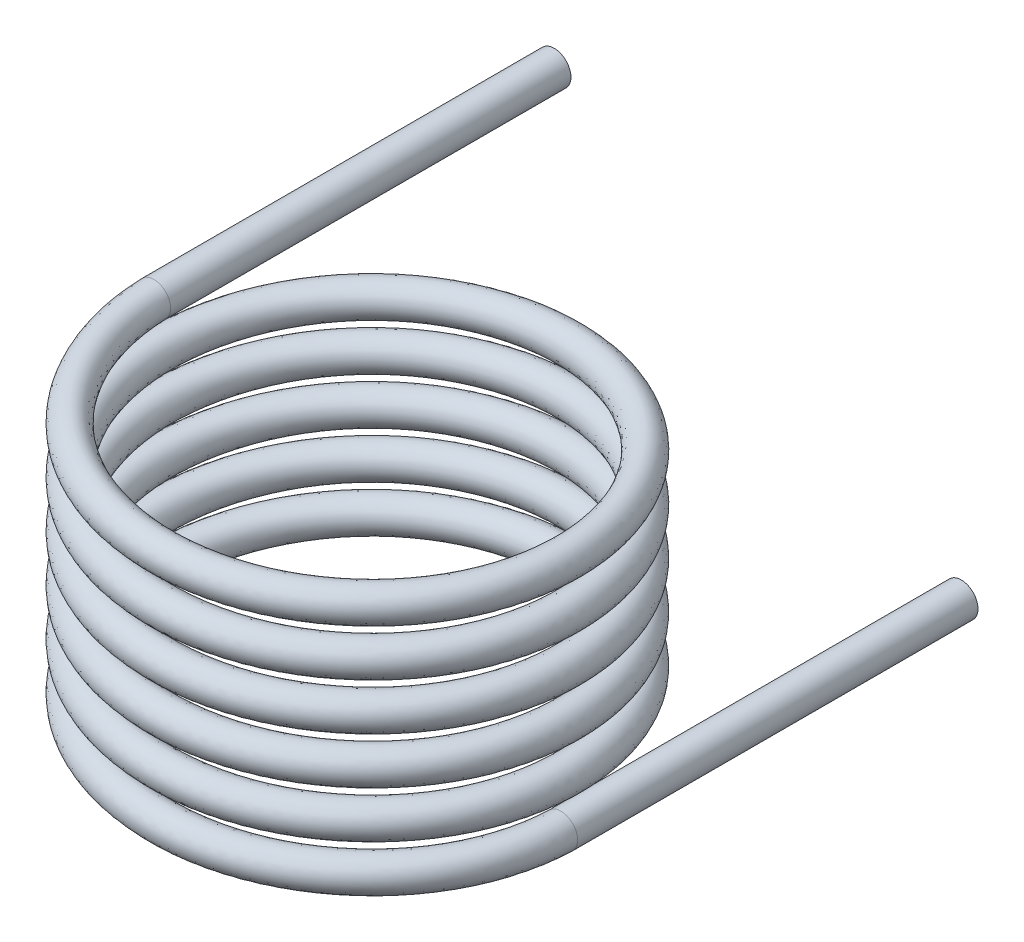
ISO-10303-21;
HEADER;
FILE_DESCRIPTION(('STEP AP214'),'2;1');
FILE_NAME('part.step','',(''),(''),'','','');
FILE_SCHEMA(('AUTOMOTIVE_DESIGN { 1 0 10303 214 1 1 1 1 }'));
ENDSEC;
DATA;
#1=APPLICATION_CONTEXT('core data for automotive mechanical design processes');
#2=APPLICATION_PROTOCOL_DEFINITION('international standard','automotive_design',2000,#1);
#3=PRODUCT_CONTEXT('',#1,'mechanical');
#4=PRODUCT('Part','Part','',(#3));
#5=PRODUCT_RELATED_PRODUCT_CATEGORY('part','',(#4));
#6=PRODUCT_DEFINITION_FORMATION('','',#4);
#7=PRODUCT_DEFINITION_CONTEXT('part definition',#1,'design');
#8=PRODUCT_DEFINITION('design','',#6,#7);
#9=PRODUCT_DEFINITION_SHAPE('','',#8);
#10=(LENGTH_UNIT() NAMED_UNIT(*) SI_UNIT(.MILLI.,.METRE.));
#11=(NAMED_UNIT(*) PLANE_ANGLE_UNIT() SI_UNIT($,.RADIAN.));
#12=(NAMED_UNIT(*) SI_UNIT($,.STERADIAN.) SOLID_ANGLE_UNIT());
#13=UNCERTAINTY_MEASURE_WITH_UNIT(LENGTH_MEASURE(1.E-05),#10,'distance_accuracy_value','');
#14=(GEOMETRIC_REPRESENTATION_CONTEXT(3) GLOBAL_UNCERTAINTY_ASSIGNED_CONTEXT((#13)) GLOBAL_UNIT_ASSIGNED_CONTEXT((#10,
#11,#12)) REPRESENTATION_CONTEXT('',''));
#15=CARTESIAN_POINT('',(0.,0.,0.));
#16=DIRECTION('',(0.,0.,1.));
#17=DIRECTION('',(1.,0.,0.));
#18=AXIS2_PLACEMENT_3D('',#15,#16,#17);
#19=CARTESIAN_POINT('',(32.9992798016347,-38.4923840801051,-2.26083684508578E-12));
#20=CARTESIAN_POINT('',(32.999279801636,-37.9090507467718,19.0521430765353));
#21=CARTESIAN_POINT('',(16.4996399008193,-37.3257174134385,28.5782146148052));
#22=CARTESIAN_POINT('',(2.61292273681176E-12,-36.7423840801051,38.1042861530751));
#23=CARTESIAN_POINT('',(-16.4996399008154,-36.1590507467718,28.5782146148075));
#24=CARTESIAN_POINT('',(-32.9992798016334,-35.5757174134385,19.0521430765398));
#25=CARTESIAN_POINT('',(-32.9992798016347,-34.9923840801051,2.26487809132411E-12));
#26=CARTESIAN_POINT('',(-32.999279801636,-34.4090507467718,-19.0521430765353));
#27=CARTESIAN_POINT('',(-16.4996399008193,-33.8257174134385,-28.5782146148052));
#28=CARTESIAN_POINT('',(-2.61758916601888E-12,-33.2423840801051,-38.1042861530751));
#29=CARTESIAN_POINT('',(16.4996399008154,-32.6590507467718,-28.5782146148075));
#30=CARTESIAN_POINT('',(32.9992798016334,-32.0757174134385,-19.0521430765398));
#31=CARTESIAN_POINT('',(32.9992798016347,-31.4923840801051,-2.26083684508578E-12));
#32=CARTESIAN_POINT('',(32.999279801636,-30.9090507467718,19.0521430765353));
#33=CARTESIAN_POINT('',(16.4996399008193,-30.3257174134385,28.5782146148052));
#34=CARTESIAN_POINT('',(2.61292273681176E-12,-29.7423840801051,38.1042861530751));
#35=CARTESIAN_POINT('',(-16.4996399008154,-29.1590507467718,28.5782146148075));
#36=CARTESIAN_POINT('',(-32.9992798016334,-28.5757174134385,19.0521430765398));
#37=CARTESIAN_POINT('',(-32.9992798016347,-27.9923840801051,2.26487809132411E-12));
#38=CARTESIAN_POINT('',(-32.999279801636,-27.4090507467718,-19.0521430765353));
#39=CARTESIAN_POINT('',(-16.4996399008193,-26.8257174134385,-28.5782146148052));
#40=CARTESIAN_POINT('',(-2.61758916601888E-12,-26.2423840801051,-38.1042861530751));
#41=CARTESIAN_POINT('',(16.4996399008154,-25.6590507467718,-28.5782146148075));
#42=CARTESIAN_POINT('',(32.9992798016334,-25.0757174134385,-19.0521430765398));
#43=CARTESIAN_POINT('',(32.9992798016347,-24.4923840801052,-2.26083684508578E-12));
#44=CARTESIAN_POINT('',(32.999279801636,-23.9090507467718,19.0521430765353));
#45=CARTESIAN_POINT('',(16.4996399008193,-23.3257174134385,28.5782146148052));
#46=CARTESIAN_POINT('',(2.61292273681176E-12,-22.7423840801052,38.1042861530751));
#47=CARTESIAN_POINT('',(-16.4996399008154,-22.1590507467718,28.5782146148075));
#48=CARTESIAN_POINT('',(-32.9992798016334,-21.5757174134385,19.0521430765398));
#49=CARTESIAN_POINT('',(-32.9992798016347,-20.9923840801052,2.26487809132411E-12));
#50=CARTESIAN_POINT('',(-32.999279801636,-20.4090507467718,-19.0521430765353));
#51=CARTESIAN_POINT('',(-16.4996399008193,-19.8257174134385,-28.5782146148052));
#52=CARTESIAN_POINT('',(-2.61758916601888E-12,-19.2423840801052,-38.1042861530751));
#53=CARTESIAN_POINT('',(16.4996399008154,-18.6590507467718,-28.5782146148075));
#54=CARTESIAN_POINT('',(32.9992798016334,-18.0757174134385,-19.0521430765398));
#55=CARTESIAN_POINT('',(32.9992798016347,-17.4923840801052,-2.26083684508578E-12));
#56=CARTESIAN_POINT('',(32.999279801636,-16.9090507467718,19.0521430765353));
#57=CARTESIAN_POINT('',(16.4996399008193,-16.3257174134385,28.5782146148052));
#58=CARTESIAN_POINT('',(2.61292273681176E-12,-15.7423840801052,38.1042861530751));
#59=CARTESIAN_POINT('',(-16.4996399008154,-15.1590507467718,28.5782146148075));
#60=CARTESIAN_POINT('',(-32.9992798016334,-14.5757174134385,19.0521430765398));
#61=CARTESIAN_POINT('',(-32.9992798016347,-13.9923840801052,2.26487809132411E-12));
#62=CARTESIAN_POINT('',(-32.999279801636,-13.4090507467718,-19.0521430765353));
#63=CARTESIAN_POINT('',(-16.4996399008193,-12.8257174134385,-28.5782146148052));
#64=CARTESIAN_POINT('',(-2.61758916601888E-12,-12.2423840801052,-38.1042861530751));
#65=CARTESIAN_POINT('',(16.4996399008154,-11.6590507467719,-28.5782146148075));
#66=CARTESIAN_POINT('',(32.9992798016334,-11.0757174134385,-19.0521430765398));
#67=CARTESIAN_POINT('',(32.9992798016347,-10.4923840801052,-2.26083684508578E-12));
#68=CARTESIAN_POINT('',(32.999279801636,-9.90905074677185,19.0521430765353));
#69=CARTESIAN_POINT('',(16.4996399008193,-9.32571741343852,28.5782146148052));
#70=CARTESIAN_POINT('',(2.61292273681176E-12,-8.74238408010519,38.1042861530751));
#71=CARTESIAN_POINT('',(-16.4996399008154,-8.15905074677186,28.5782146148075));
#72=CARTESIAN_POINT('',(-32.9992798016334,-7.57571741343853,19.0521430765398));
#73=CARTESIAN_POINT('',(-32.9992798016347,-6.99238408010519,2.26487809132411E-12));
#74=CARTESIAN_POINT('',(-32.999279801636,-6.40905074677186,-19.0521430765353));
#75=CARTESIAN_POINT('',(-16.4996399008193,-5.82571741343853,-28.5782146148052));
#76=CARTESIAN_POINT('',(-2.61758916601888E-12,-5.2423840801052,-38.1042861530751));
#77=CARTESIAN_POINT('',(16.4996399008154,-4.65905074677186,-28.5782146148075));
#78=CARTESIAN_POINT('',(32.9992798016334,-4.07571741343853,-19.0521430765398));
#79=CARTESIAN_POINT('',(32.9992798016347,-3.4923840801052,-2.26083684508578E-12));
#80=CARTESIAN_POINT('',(32.999279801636,-2.90905074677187,19.0521430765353));
#81=CARTESIAN_POINT('',(16.4996399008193,-2.32571741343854,28.5782146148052));
#82=CARTESIAN_POINT('',(2.61292273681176E-12,-1.74238408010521,38.1042861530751));
#83=CARTESIAN_POINT('',(-16.4996399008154,-1.15905074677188,28.5782146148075));
#84=CARTESIAN_POINT('',(-32.9992798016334,-0.575717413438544,19.0521430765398));
#85=CARTESIAN_POINT('',(-32.9992798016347,0.00761591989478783,2.26487809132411E-12));
#86=CARTESIAN_POINT('',(-32.999279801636,0.590949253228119,-19.0521430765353));
#87=CARTESIAN_POINT('',(-16.4996399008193,1.17428258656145,-28.5782146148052));
#88=CARTESIAN_POINT('',(-2.61758916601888E-12,1.75761591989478,-38.1042861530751));
#89=CARTESIAN_POINT('',(16.4996399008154,2.34094925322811,-28.5782146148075));
#90=CARTESIAN_POINT('',(32.9992798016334,2.92428258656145,-19.0521430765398));
#91=CARTESIAN_POINT('',(32.9992798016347,3.50761591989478,-2.26083684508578E-12));
#92=CARTESIAN_POINT('',(32.9992798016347,-33.4923840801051,-2.26083684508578E-12));
#93=CARTESIAN_POINT('',(32.999279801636,-32.9090507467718,19.0521430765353));
#94=CARTESIAN_POINT('',(16.4996399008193,-32.3257174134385,28.5782146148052));
#95=CARTESIAN_POINT('',(2.61292273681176E-12,-31.7423840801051,38.1042861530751));
#96=CARTESIAN_POINT('',(-16.4996399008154,-31.1590507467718,28.5782146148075));
#97=CARTESIAN_POINT('',(-32.9992798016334,-30.5757174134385,19.0521430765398));
#98=CARTESIAN_POINT('',(-32.9992798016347,-29.9923840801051,2.26487809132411E-12));
#99=CARTESIAN_POINT('',(-32.999279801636,-29.4090507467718,-19.0521430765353));
#100=CARTESIAN_POINT('',(-16.4996399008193,-28.8257174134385,-28.5782146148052));
#101=CARTESIAN_POINT('',(-2.61758916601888E-12,-28.2423840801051,-38.1042861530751));
#102=CARTESIAN_POINT('',(16.4996399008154,-27.6590507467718,-28.5782146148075));
#103=CARTESIAN_POINT('',(32.9992798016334,-27.0757174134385,-19.0521430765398));
#104=CARTESIAN_POINT('',(32.9992798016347,-26.4923840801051,-2.26083684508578E-12));
#105=CARTESIAN_POINT('',(32.999279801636,-25.9090507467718,19.0521430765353));
#106=CARTESIAN_POINT('',(16.4996399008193,-25.3257174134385,28.5782146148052));
#107=CARTESIAN_POINT('',(2.61292273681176E-12,-24.7423840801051,38.1042861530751));
#108=CARTESIAN_POINT('',(-16.4996399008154,-24.1590507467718,28.5782146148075));
#109=CARTESIAN_POINT('',(-32.9992798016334,-23.5757174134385,19.0521430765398));
#110=CARTESIAN_POINT('',(-32.9992798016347,-22.9923840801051,2.26487809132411E-12));
#111=CARTESIAN_POINT('',(-32.999279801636,-22.4090507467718,-19.0521430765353));
#112=CARTESIAN_POINT('',(-16.4996399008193,-21.8257174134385,-28.5782146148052));
#113=CARTESIAN_POINT('',(-2.61758916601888E-12,-21.2423840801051,-38.1042861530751));
#114=CARTESIAN_POINT('',(16.4996399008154,-20.6590507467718,-28.5782146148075));
#115=CARTESIAN_POINT('',(32.9992798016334,-20.0757174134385,-19.0521430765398));
#116=CARTESIAN_POINT('',(32.9992798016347,-19.4923840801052,-2.26083684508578E-12));
#117=CARTESIAN_POINT('',(32.999279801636,-18.9090507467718,19.0521430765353));
#118=CARTESIAN_POINT('',(16.4996399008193,-18.3257174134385,28.5782146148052));
#119=CARTESIAN_POINT('',(2.61292273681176E-12,-17.7423840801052,38.1042861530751));
#120=CARTESIAN_POINT('',(-16.4996399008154,-17.1590507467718,28.5782146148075));
#121=CARTESIAN_POINT('',(-32.9992798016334,-16.5757174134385,19.0521430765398));
#122=CARTESIAN_POINT('',(-32.9992798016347,-15.9923840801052,2.26487809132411E-12));
#123=CARTESIAN_POINT('',(-32.999279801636,-15.4090507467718,-19.0521430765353));
#124=CARTESIAN_POINT('',(-16.4996399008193,-14.8257174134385,-28.5782146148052));
#125=CARTESIAN_POINT('',(-2.61758916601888E-12,-14.2423840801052,-38.1042861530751));
#126=CARTESIAN_POINT('',(16.4996399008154,-13.6590507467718,-28.5782146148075));
#127=CARTESIAN_POINT('',(32.9992798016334,-13.0757174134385,-19.0521430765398));
#128=CARTESIAN_POINT('',(32.9992798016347,-12.4923840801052,-2.26083684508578E-12));
#129=CARTESIAN_POINT('',(32.999279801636,-11.9090507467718,19.0521430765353));
#130=CARTESIAN_POINT('',(16.4996399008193,-11.3257174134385,28.5782146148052));
#131=CARTESIAN_POINT('',(2.61292273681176E-12,-10.7423840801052,38.1042861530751));
#132=CARTESIAN_POINT('',(-16.4996399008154,-10.1590507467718,28.5782146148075));
#133=CARTESIAN_POINT('',(-32.9992798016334,-9.57571741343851,19.0521430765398));
#134=CARTESIAN_POINT('',(-32.9992798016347,-8.99238408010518,2.26487809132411E-12));
#135=CARTESIAN_POINT('',(-32.999279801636,-8.40905074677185,-19.0521430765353));
#136=CARTESIAN_POINT('',(-16.4996399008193,-7.82571741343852,-28.5782146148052));
#137=CARTESIAN_POINT('',(-2.61758916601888E-12,-7.24238408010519,-38.1042861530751));
#138=CARTESIAN_POINT('',(16.4996399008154,-6.65905074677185,-28.5782146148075));
#139=CARTESIAN_POINT('',(32.9992798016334,-6.07571741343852,-19.0521430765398));
#140=CARTESIAN_POINT('',(32.9992798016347,-5.49238408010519,-2.26083684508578E-12));
#141=CARTESIAN_POINT('',(32.999279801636,-4.90905074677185,19.0521430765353));
#142=CARTESIAN_POINT('',(16.4996399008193,-4.32571741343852,28.5782146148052));
#143=CARTESIAN_POINT('',(2.61292273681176E-12,-3.74238408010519,38.1042861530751));
#144=CARTESIAN_POINT('',(-16.4996399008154,-3.15905074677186,28.5782146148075));
#145=CARTESIAN_POINT('',(-32.9992798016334,-2.57571741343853,19.0521430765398));
#146=CARTESIAN_POINT('',(-32.9992798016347,-1.99238408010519,2.26487809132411E-12));
#147=CARTESIAN_POINT('',(-32.999279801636,-1.40905074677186,-19.0521430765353));
#148=CARTESIAN_POINT('',(-16.4996399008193,-0.82571741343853,-28.5782146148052));
#149=CARTESIAN_POINT('',(-2.61758916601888E-12,-0.242384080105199,-38.1042861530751));
#150=CARTESIAN_POINT('',(16.4996399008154,0.340949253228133,-28.5782146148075));
#151=CARTESIAN_POINT('',(32.9992798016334,0.924282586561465,-19.0521430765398));
#152=CARTESIAN_POINT('',(32.9992798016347,1.5076159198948,-2.26083684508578E-12));
#153=CARTESIAN_POINT('',(32.999279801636,2.09094925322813,19.0521430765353));
#154=CARTESIAN_POINT('',(16.4996399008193,2.67428258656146,28.5782146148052));
#155=CARTESIAN_POINT('',(2.61292273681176E-12,3.25761591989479,38.1042861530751));
#156=CARTESIAN_POINT('',(-16.4996399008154,3.84094925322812,28.5782146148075));
#157=CARTESIAN_POINT('',(-32.9992798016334,4.42428258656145,19.0521430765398));
#158=CARTESIAN_POINT('',(-32.9992798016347,5.00761591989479,2.26487809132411E-12));
#159=CARTESIAN_POINT('',(-32.999279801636,5.59094925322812,-19.0521430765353));
#160=CARTESIAN_POINT('',(-16.4996399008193,6.17428258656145,-28.5782146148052));
#161=CARTESIAN_POINT('',(-2.61758916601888E-12,6.75761591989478,-38.1042861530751));
#162=CARTESIAN_POINT('',(16.4996399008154,7.34094925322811,-28.5782146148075));
#163=CARTESIAN_POINT('',(32.9992798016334,7.92428258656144,-19.0521430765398));
#164=CARTESIAN_POINT('',(32.9992798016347,8.50761591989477,-2.26083684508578E-12));
#165=CARTESIAN_POINT('',(27.9992798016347,-33.4923840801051,-1.91827833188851E-12));
#166=CARTESIAN_POINT('',(27.9992798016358,-32.9090507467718,16.1653917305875));
#167=CARTESIAN_POINT('',(13.999639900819,-32.3257174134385,24.2480875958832));
#168=CARTESIAN_POINT('',(2.21701671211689E-12,-31.7423840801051,32.3307834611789));
#169=CARTESIAN_POINT('',(-13.9996399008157,-31.1590507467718,24.2480875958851));
#170=CARTESIAN_POINT('',(-27.9992798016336,-30.5757174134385,16.1653917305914));
#171=CARTESIAN_POINT('',(-27.9992798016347,-29.9923840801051,1.92170725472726E-12));
#172=CARTESIAN_POINT('',(-27.9992798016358,-29.4090507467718,-16.1653917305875));
#173=CARTESIAN_POINT('',(-13.999639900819,-28.8257174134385,-24.2480875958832));
#174=CARTESIAN_POINT('',(-2.22097609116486E-12,-28.2423840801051,-32.3307834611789));
#175=CARTESIAN_POINT('',(13.9996399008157,-27.6590507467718,-24.2480875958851));
#176=CARTESIAN_POINT('',(27.9992798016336,-27.0757174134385,-16.1653917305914));
#177=CARTESIAN_POINT('',(27.9992798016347,-26.4923840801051,-1.91827833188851E-12));
#178=CARTESIAN_POINT('',(27.9992798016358,-25.9090507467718,16.1653917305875));
#179=CARTESIAN_POINT('',(13.999639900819,-25.3257174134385,24.2480875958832));
#180=CARTESIAN_POINT('',(2.21701671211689E-12,-24.7423840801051,32.3307834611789));
#181=CARTESIAN_POINT('',(-13.9996399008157,-24.1590507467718,24.2480875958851));
#182=CARTESIAN_POINT('',(-27.9992798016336,-23.5757174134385,16.1653917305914));
#183=CARTESIAN_POINT('',(-27.9992798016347,-22.9923840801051,1.92170725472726E-12));
#184=CARTESIAN_POINT('',(-27.9992798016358,-22.4090507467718,-16.1653917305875));
#185=CARTESIAN_POINT('',(-13.999639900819,-21.8257174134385,-24.2480875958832));
#186=CARTESIAN_POINT('',(-2.22097609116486E-12,-21.2423840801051,-32.3307834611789));
#187=CARTESIAN_POINT('',(13.9996399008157,-20.6590507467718,-24.2480875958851));
#188=CARTESIAN_POINT('',(27.9992798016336,-20.0757174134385,-16.1653917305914));
#189=CARTESIAN_POINT('',(27.9992798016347,-19.4923840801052,-1.91827833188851E-12));
#190=CARTESIAN_POINT('',(27.9992798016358,-18.9090507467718,16.1653917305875));
#191=CARTESIAN_POINT('',(13.999639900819,-18.3257174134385,24.2480875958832));
#192=CARTESIAN_POINT('',(2.21701671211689E-12,-17.7423840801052,32.3307834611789));
#193=CARTESIAN_POINT('',(-13.9996399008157,-17.1590507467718,24.2480875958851));
#194=CARTESIAN_POINT('',(-27.9992798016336,-16.5757174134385,16.1653917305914));
#195=CARTESIAN_POINT('',(-27.9992798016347,-15.9923840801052,1.92170725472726E-12));
#196=CARTESIAN_POINT('',(-27.9992798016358,-15.4090507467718,-16.1653917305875));
#197=CARTESIAN_POINT('',(-13.999639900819,-14.8257174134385,-24.2480875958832));
#198=CARTESIAN_POINT('',(-2.22097609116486E-12,-14.2423840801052,-32.3307834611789));
#199=CARTESIAN_POINT('',(13.9996399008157,-13.6590507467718,-24.2480875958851));
#200=CARTESIAN_POINT('',(27.9992798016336,-13.0757174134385,-16.1653917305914));
#201=CARTESIAN_POINT('',(27.9992798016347,-12.4923840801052,-1.91827833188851E-12));
#202=CARTESIAN_POINT('',(27.9992798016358,-11.9090507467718,16.1653917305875));
#203=CARTESIAN_POINT('',(13.999639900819,-11.3257174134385,24.2480875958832));
#204=CARTESIAN_POINT('',(2.21701671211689E-12,-10.7423840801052,32.3307834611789));
#205=CARTESIAN_POINT('',(-13.9996399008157,-10.1590507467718,24.2480875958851));
#206=CARTESIAN_POINT('',(-27.9992798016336,-9.57571741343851,16.1653917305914));
#207=CARTESIAN_POINT('',(-27.9992798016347,-8.99238408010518,1.92170725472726E-12));
#208=CARTESIAN_POINT('',(-27.9992798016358,-8.40905074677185,-16.1653917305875));
#209=CARTESIAN_POINT('',(-13.999639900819,-7.82571741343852,-24.2480875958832));
#210=CARTESIAN_POINT('',(-2.22097609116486E-12,-7.24238408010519,-32.3307834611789));
#211=CARTESIAN_POINT('',(13.9996399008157,-6.65905074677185,-24.2480875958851));
#212=CARTESIAN_POINT('',(27.9992798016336,-6.07571741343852,-16.1653917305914));
#213=CARTESIAN_POINT('',(27.9992798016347,-5.49238408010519,-1.91827833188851E-12));
#214=CARTESIAN_POINT('',(27.9992798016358,-4.90905074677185,16.1653917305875));
#215=CARTESIAN_POINT('',(13.999639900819,-4.32571741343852,24.2480875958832));
#216=CARTESIAN_POINT('',(2.21701671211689E-12,-3.74238408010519,32.3307834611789));
#217=CARTESIAN_POINT('',(-13.9996399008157,-3.15905074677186,24.2480875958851));
#218=CARTESIAN_POINT('',(-27.9992798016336,-2.57571741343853,16.1653917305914));
#219=CARTESIAN_POINT('',(-27.9992798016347,-1.99238408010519,1.92170725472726E-12));
#220=CARTESIAN_POINT('',(-27.9992798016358,-1.40905074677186,-16.1653917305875));
#221=CARTESIAN_POINT('',(-13.999639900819,-0.82571741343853,-24.2480875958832));
#222=CARTESIAN_POINT('',(-2.22097609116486E-12,-0.242384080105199,-32.3307834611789));
#223=CARTESIAN_POINT('',(13.9996399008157,0.340949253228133,-24.2480875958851));
#224=CARTESIAN_POINT('',(27.9992798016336,0.924282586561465,-16.1653917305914));
#225=CARTESIAN_POINT('',(27.9992798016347,1.5076159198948,-1.91827833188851E-12));
#226=CARTESIAN_POINT('',(27.9992798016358,2.09094925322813,16.1653917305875));
#227=CARTESIAN_POINT('',(13.999639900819,2.67428258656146,24.2480875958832));
#228=CARTESIAN_POINT('',(2.21701671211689E-12,3.25761591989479,32.3307834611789));
#229=CARTESIAN_POINT('',(-13.9996399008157,3.84094925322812,24.2480875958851));
#230=CARTESIAN_POINT('',(-27.9992798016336,4.42428258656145,16.1653917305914));
#231=CARTESIAN_POINT('',(-27.9992798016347,5.00761591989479,1.92170725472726E-12));
#232=CARTESIAN_POINT('',(-27.9992798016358,5.59094925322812,-16.1653917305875));
#233=CARTESIAN_POINT('',(-13.999639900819,6.17428258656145,-24.2480875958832));
#234=CARTESIAN_POINT('',(-2.22097609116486E-12,6.75761591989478,-32.3307834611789));
#235=CARTESIAN_POINT('',(13.9996399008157,7.34094925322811,-24.2480875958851));
#236=CARTESIAN_POINT('',(27.9992798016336,7.92428258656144,-16.1653917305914));
#237=CARTESIAN_POINT('',(27.9992798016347,8.50761591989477,-1.91827833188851E-12));
#238=CARTESIAN_POINT('',(27.9992798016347,-38.4923840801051,-1.91827833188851E-12));
#239=CARTESIAN_POINT('',(27.9992798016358,-37.9090507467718,16.1653917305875));
#240=CARTESIAN_POINT('',(13.999639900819,-37.3257174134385,24.2480875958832));
#241=CARTESIAN_POINT('',(2.21701671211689E-12,-36.7423840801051,32.3307834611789));
#242=CARTESIAN_POINT('',(-13.9996399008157,-36.1590507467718,24.2480875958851));
#243=CARTESIAN_POINT('',(-27.9992798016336,-35.5757174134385,16.1653917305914));
#244=CARTESIAN_POINT('',(-27.9992798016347,-34.9923840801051,1.92170725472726E-12));
#245=CARTESIAN_POINT('',(-27.9992798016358,-34.4090507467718,-16.1653917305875));
#246=CARTESIAN_POINT('',(-13.999639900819,-33.8257174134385,-24.2480875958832));
#247=CARTESIAN_POINT('',(-2.22097609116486E-12,-33.2423840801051,-32.3307834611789));
#248=CARTESIAN_POINT('',(13.9996399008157,-32.6590507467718,-24.2480875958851));
#249=CARTESIAN_POINT('',(27.9992798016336,-32.0757174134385,-16.1653917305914));
#250=CARTESIAN_POINT('',(27.9992798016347,-31.4923840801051,-1.91827833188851E-12));
#251=CARTESIAN_POINT('',(27.9992798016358,-30.9090507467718,16.1653917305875));
#252=CARTESIAN_POINT('',(13.999639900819,-30.3257174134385,24.2480875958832));
#253=CARTESIAN_POINT('',(2.21701671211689E-12,-29.7423840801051,32.3307834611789));
#254=CARTESIAN_POINT('',(-13.9996399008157,-29.1590507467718,24.2480875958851));
#255=CARTESIAN_POINT('',(-27.9992798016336,-28.5757174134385,16.1653917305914));
#256=CARTESIAN_POINT('',(-27.9992798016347,-27.9923840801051,1.92170725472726E-12));
#257=CARTESIAN_POINT('',(-27.9992798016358,-27.4090507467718,-16.1653917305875));
#258=CARTESIAN_POINT('',(-13.999639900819,-26.8257174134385,-24.2480875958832));
#259=CARTESIAN_POINT('',(-2.22097609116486E-12,-26.2423840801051,-32.3307834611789));
#260=CARTESIAN_POINT('',(13.9996399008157,-25.6590507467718,-24.2480875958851));
#261=CARTESIAN_POINT('',(27.9992798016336,-25.0757174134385,-16.1653917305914));
#262=CARTESIAN_POINT('',(27.9992798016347,-24.4923840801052,-1.91827833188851E-12));
#263=CARTESIAN_POINT('',(27.9992798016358,-23.9090507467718,16.1653917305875));
#264=CARTESIAN_POINT('',(13.999639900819,-23.3257174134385,24.2480875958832));
#265=CARTESIAN_POINT('',(2.21701671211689E-12,-22.7423840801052,32.3307834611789));
#266=CARTESIAN_POINT('',(-13.9996399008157,-22.1590507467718,24.2480875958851));
#267=CARTESIAN_POINT('',(-27.9992798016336,-21.5757174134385,16.1653917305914));
#268=CARTESIAN_POINT('',(-27.9992798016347,-20.9923840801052,1.92170725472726E-12));
#269=CARTESIAN_POINT('',(-27.9992798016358,-20.4090507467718,-16.1653917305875));
#270=CARTESIAN_POINT('',(-13.999639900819,-19.8257174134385,-24.2480875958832));
#271=CARTESIAN_POINT('',(-2.22097609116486E-12,-19.2423840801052,-32.3307834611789));
#272=CARTESIAN_POINT('',(13.9996399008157,-18.6590507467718,-24.2480875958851));
#273=CARTESIAN_POINT('',(27.9992798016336,-18.0757174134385,-16.1653917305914));
#274=CARTESIAN_POINT('',(27.9992798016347,-17.4923840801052,-1.91827833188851E-12));
#275=CARTESIAN_POINT('',(27.9992798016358,-16.9090507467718,16.1653917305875));
#276=CARTESIAN_POINT('',(13.999639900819,-16.3257174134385,24.2480875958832));
#277=CARTESIAN_POINT('',(2.21701671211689E-12,-15.7423840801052,32.3307834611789));
#278=CARTESIAN_POINT('',(-13.9996399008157,-15.1590507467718,24.2480875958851));
#279=CARTESIAN_POINT('',(-27.9992798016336,-14.5757174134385,16.1653917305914));
#280=CARTESIAN_POINT('',(-27.9992798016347,-13.9923840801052,1.92170725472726E-12));
#281=CARTESIAN_POINT('',(-27.9992798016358,-13.4090507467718,-16.1653917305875));
#282=CARTESIAN_POINT('',(-13.999639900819,-12.8257174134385,-24.2480875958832));
#283=CARTESIAN_POINT('',(-2.22097609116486E-12,-12.2423840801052,-32.3307834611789));
#284=CARTESIAN_POINT('',(13.9996399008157,-11.6590507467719,-24.2480875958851));
#285=CARTESIAN_POINT('',(27.9992798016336,-11.0757174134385,-16.1653917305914));
#286=CARTESIAN_POINT('',(27.9992798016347,-10.4923840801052,-1.91827833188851E-12));
#287=CARTESIAN_POINT('',(27.9992798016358,-9.90905074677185,16.1653917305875));
#288=CARTESIAN_POINT('',(13.999639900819,-9.32571741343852,24.2480875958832));
#289=CARTESIAN_POINT('',(2.21701671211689E-12,-8.74238408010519,32.3307834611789));
#290=CARTESIAN_POINT('',(-13.9996399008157,-8.15905074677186,24.2480875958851));
#291=CARTESIAN_POINT('',(-27.9992798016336,-7.57571741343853,16.1653917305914));
#292=CARTESIAN_POINT('',(-27.9992798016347,-6.99238408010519,1.92170725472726E-12));
#293=CARTESIAN_POINT('',(-27.9992798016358,-6.40905074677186,-16.1653917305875));
#294=CARTESIAN_POINT('',(-13.999639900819,-5.82571741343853,-24.2480875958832));
#295=CARTESIAN_POINT('',(-2.22097609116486E-12,-5.2423840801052,-32.3307834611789));
#296=CARTESIAN_POINT('',(13.9996399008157,-4.65905074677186,-24.2480875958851));
#297=CARTESIAN_POINT('',(27.9992798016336,-4.07571741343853,-16.1653917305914));
#298=CARTESIAN_POINT('',(27.9992798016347,-3.4923840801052,-1.91827833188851E-12));
#299=CARTESIAN_POINT('',(27.9992798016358,-2.90905074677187,16.1653917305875));
#300=CARTESIAN_POINT('',(13.999639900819,-2.32571741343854,24.2480875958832));
#301=CARTESIAN_POINT('',(2.21701671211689E-12,-1.74238408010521,32.3307834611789));
#302=CARTESIAN_POINT('',(-13.9996399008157,-1.15905074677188,24.2480875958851));
#303=CARTESIAN_POINT('',(-27.9992798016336,-0.575717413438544,16.1653917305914));
#304=CARTESIAN_POINT('',(-27.9992798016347,0.00761591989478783,1.92170725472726E-12));
#305=CARTESIAN_POINT('',(-27.9992798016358,0.590949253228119,-16.1653917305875));
#306=CARTESIAN_POINT('',(-13.999639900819,1.17428258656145,-24.2480875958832));
#307=CARTESIAN_POINT('',(-2.22097609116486E-12,1.75761591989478,-32.3307834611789));
#308=CARTESIAN_POINT('',(13.9996399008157,2.34094925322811,-24.2480875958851));
#309=CARTESIAN_POINT('',(27.9992798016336,2.92428258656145,-16.1653917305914));
#310=CARTESIAN_POINT('',(27.9992798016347,3.50761591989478,-1.91827833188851E-12));
#311=CARTESIAN_POINT('',(27.9992798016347,-43.4923840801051,-1.91827833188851E-12));
#312=CARTESIAN_POINT('',(27.9992798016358,-42.9090507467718,16.1653917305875));
#313=CARTESIAN_POINT('',(13.999639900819,-42.3257174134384,24.2480875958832));
#314=CARTESIAN_POINT('',(2.21701671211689E-12,-41.7423840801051,32.3307834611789));
#315=CARTESIAN_POINT('',(-13.9996399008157,-41.1590507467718,24.2480875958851));
#316=CARTESIAN_POINT('',(-27.9992798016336,-40.5757174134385,16.1653917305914));
#317=CARTESIAN_POINT('',(-27.9992798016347,-39.9923840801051,1.92170725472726E-12));
#318=CARTESIAN_POINT('',(-27.9992798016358,-39.4090507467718,-16.1653917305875));
#319=CARTESIAN_POINT('',(-13.999639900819,-38.8257174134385,-24.2480875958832));
#320=CARTESIAN_POINT('',(-2.22097609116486E-12,-38.2423840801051,-32.3307834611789));
#321=CARTESIAN_POINT('',(13.9996399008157,-37.6590507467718,-24.2480875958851));
#322=CARTESIAN_POINT('',(27.9992798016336,-37.0757174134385,-16.1653917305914));
#323=CARTESIAN_POINT('',(27.9992798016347,-36.4923840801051,-1.91827833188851E-12));
#324=CARTESIAN_POINT('',(27.9992798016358,-35.9090507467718,16.1653917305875));
#325=CARTESIAN_POINT('',(13.999639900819,-35.3257174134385,24.2480875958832));
#326=CARTESIAN_POINT('',(2.21701671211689E-12,-34.7423840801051,32.3307834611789));
#327=CARTESIAN_POINT('',(-13.9996399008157,-34.1590507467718,24.2480875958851));
#328=CARTESIAN_POINT('',(-27.9992798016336,-33.5757174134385,16.1653917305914));
#329=CARTESIAN_POINT('',(-27.9992798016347,-32.9923840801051,1.92170725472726E-12));
#330=CARTESIAN_POINT('',(-27.9992798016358,-32.4090507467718,-16.1653917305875));
#331=CARTESIAN_POINT('',(-13.999639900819,-31.8257174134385,-24.2480875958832));
#332=CARTESIAN_POINT('',(-2.22097609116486E-12,-31.2423840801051,-32.3307834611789));
#333=CARTESIAN_POINT('',(13.9996399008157,-30.6590507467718,-24.2480875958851));
#334=CARTESIAN_POINT('',(27.9992798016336,-30.0757174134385,-16.1653917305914));
#335=CARTESIAN_POINT('',(27.9992798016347,-29.4923840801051,-1.91827833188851E-12));
#336=CARTESIAN_POINT('',(27.9992798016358,-28.9090507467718,16.1653917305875));
#337=CARTESIAN_POINT('',(13.999639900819,-28.3257174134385,24.2480875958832));
#338=CARTESIAN_POINT('',(2.21701671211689E-12,-27.7423840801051,32.3307834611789));
#339=CARTESIAN_POINT('',(-13.9996399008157,-27.1590507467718,24.2480875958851));
#340=CARTESIAN_POINT('',(-27.9992798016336,-26.5757174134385,16.1653917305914));
#341=CARTESIAN_POINT('',(-27.9992798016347,-25.9923840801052,1.92170725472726E-12));
#342=CARTESIAN_POINT('',(-27.9992798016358,-25.4090507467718,-16.1653917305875));
#343=CARTESIAN_POINT('',(-13.999639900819,-24.8257174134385,-24.2480875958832));
#344=CARTESIAN_POINT('',(-2.22097609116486E-12,-24.2423840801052,-32.3307834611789));
#345=CARTESIAN_POINT('',(13.9996399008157,-23.6590507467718,-24.2480875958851));
#346=CARTESIAN_POINT('',(27.9992798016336,-23.0757174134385,-16.1653917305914));
#347=CARTESIAN_POINT('',(27.9992798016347,-22.4923840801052,-1.91827833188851E-12));
#348=CARTESIAN_POINT('',(27.9992798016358,-21.9090507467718,16.1653917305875));
#349=CARTESIAN_POINT('',(13.999639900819,-21.3257174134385,24.2480875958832));
#350=CARTESIAN_POINT('',(2.21701671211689E-12,-20.7423840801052,32.3307834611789));
#351=CARTESIAN_POINT('',(-13.9996399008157,-20.1590507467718,24.2480875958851));
#352=CARTESIAN_POINT('',(-27.9992798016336,-19.5757174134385,16.1653917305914));
#353=CARTESIAN_POINT('',(-27.9992798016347,-18.9923840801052,1.92170725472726E-12));
#354=CARTESIAN_POINT('',(-27.9992798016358,-18.4090507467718,-16.1653917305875));
#355=CARTESIAN_POINT('',(-13.999639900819,-17.8257174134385,-24.2480875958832));
#356=CARTESIAN_POINT('',(-2.22097609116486E-12,-17.2423840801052,-32.3307834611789));
#357=CARTESIAN_POINT('',(13.9996399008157,-16.6590507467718,-24.2480875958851));
#358=CARTESIAN_POINT('',(27.9992798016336,-16.0757174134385,-16.1653917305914));
#359=CARTESIAN_POINT('',(27.9992798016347,-15.4923840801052,-1.91827833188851E-12));
#360=CARTESIAN_POINT('',(27.9992798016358,-14.9090507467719,16.1653917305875));
#361=CARTESIAN_POINT('',(13.999639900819,-14.3257174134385,24.2480875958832));
#362=CARTESIAN_POINT('',(2.21701671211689E-12,-13.7423840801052,32.3307834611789));
#363=CARTESIAN_POINT('',(-13.9996399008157,-13.1590507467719,24.2480875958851));
#364=CARTESIAN_POINT('',(-27.9992798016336,-12.5757174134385,16.1653917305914));
#365=CARTESIAN_POINT('',(-27.9992798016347,-11.9923840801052,1.92170725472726E-12));
#366=CARTESIAN_POINT('',(-27.9992798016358,-11.4090507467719,-16.1653917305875));
#367=CARTESIAN_POINT('',(-13.999639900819,-10.8257174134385,-24.2480875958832));
#368=CARTESIAN_POINT('',(-2.22097609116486E-12,-10.2423840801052,-32.3307834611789));
#369=CARTESIAN_POINT('',(13.9996399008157,-9.65905074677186,-24.2480875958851));
#370=CARTESIAN_POINT('',(27.9992798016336,-9.07571741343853,-16.1653917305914));
#371=CARTESIAN_POINT('',(27.9992798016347,-8.4923840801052,-1.91827833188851E-12));
#372=CARTESIAN_POINT('',(27.9992798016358,-7.90905074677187,16.1653917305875));
#373=CARTESIAN_POINT('',(13.999639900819,-7.32571741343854,24.2480875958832));
#374=CARTESIAN_POINT('',(2.21701671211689E-12,-6.7423840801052,32.3307834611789));
#375=CARTESIAN_POINT('',(-13.9996399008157,-6.15905074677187,24.2480875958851));
#376=CARTESIAN_POINT('',(-27.9992798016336,-5.57571741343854,16.1653917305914));
#377=CARTESIAN_POINT('',(-27.9992798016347,-4.99238408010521,1.92170725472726E-12));
#378=CARTESIAN_POINT('',(-27.9992798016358,-4.40905074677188,-16.1653917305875));
#379=CARTESIAN_POINT('',(-13.999639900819,-3.82571741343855,-24.2480875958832));
#380=CARTESIAN_POINT('',(-2.22097609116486E-12,-3.24238408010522,-32.3307834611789));
#381=CARTESIAN_POINT('',(13.9996399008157,-2.65905074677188,-24.2480875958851));
#382=CARTESIAN_POINT('',(27.9992798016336,-2.07571741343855,-16.1653917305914));
#383=CARTESIAN_POINT('',(27.9992798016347,-1.49238408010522,-1.91827833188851E-12));
#384=CARTESIAN_POINT('',(32.9992798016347,-43.4923840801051,-2.26083684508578E-12));
#385=CARTESIAN_POINT('',(32.999279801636,-42.9090507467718,19.0521430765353));
#386=CARTESIAN_POINT('',(16.4996399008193,-42.3257174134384,28.5782146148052));
#387=CARTESIAN_POINT('',(2.61292273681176E-12,-41.7423840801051,38.1042861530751));
#388=CARTESIAN_POINT('',(-16.4996399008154,-41.1590507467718,28.5782146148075));
#389=CARTESIAN_POINT('',(-32.9992798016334,-40.5757174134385,19.0521430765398));
#390=CARTESIAN_POINT('',(-32.9992798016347,-39.9923840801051,2.26487809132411E-12));
#391=CARTESIAN_POINT('',(-32.999279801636,-39.4090507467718,-19.0521430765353));
#392=CARTESIAN_POINT('',(-16.4996399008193,-38.8257174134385,-28.5782146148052));
#393=CARTESIAN_POINT('',(-2.61758916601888E-12,-38.2423840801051,-38.1042861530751));
#394=CARTESIAN_POINT('',(16.4996399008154,-37.6590507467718,-28.5782146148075));
#395=CARTESIAN_POINT('',(32.9992798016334,-37.0757174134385,-19.0521430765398));
#396=CARTESIAN_POINT('',(32.9992798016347,-36.4923840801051,-2.26083684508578E-12));
#397=CARTESIAN_POINT('',(32.999279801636,-35.9090507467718,19.0521430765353));
#398=CARTESIAN_POINT('',(16.4996399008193,-35.3257174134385,28.5782146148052));
#399=CARTESIAN_POINT('',(2.61292273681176E-12,-34.7423840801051,38.1042861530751));
#400=CARTESIAN_POINT('',(-16.4996399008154,-34.1590507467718,28.5782146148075));
#401=CARTESIAN_POINT('',(-32.9992798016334,-33.5757174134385,19.0521430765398));
#402=CARTESIAN_POINT('',(-32.9992798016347,-32.9923840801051,2.26487809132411E-12));
#403=CARTESIAN_POINT('',(-32.999279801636,-32.4090507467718,-19.0521430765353));
#404=CARTESIAN_POINT('',(-16.4996399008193,-31.8257174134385,-28.5782146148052));
#405=CARTESIAN_POINT('',(-2.61758916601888E-12,-31.2423840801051,-38.1042861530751));
#406=CARTESIAN_POINT('',(16.4996399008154,-30.6590507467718,-28.5782146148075));
#407=CARTESIAN_POINT('',(32.9992798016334,-30.0757174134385,-19.0521430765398));
#408=CARTESIAN_POINT('',(32.9992798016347,-29.4923840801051,-2.26083684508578E-12));
#409=CARTESIAN_POINT('',(32.999279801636,-28.9090507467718,19.0521430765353));
#410=CARTESIAN_POINT('',(16.4996399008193,-28.3257174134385,28.5782146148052));
#411=CARTESIAN_POINT('',(2.61292273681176E-12,-27.7423840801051,38.1042861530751));
#412=CARTESIAN_POINT('',(-16.4996399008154,-27.1590507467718,28.5782146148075));
#413=CARTESIAN_POINT('',(-32.9992798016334,-26.5757174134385,19.0521430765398));
#414=CARTESIAN_POINT('',(-32.9992798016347,-25.9923840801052,2.26487809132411E-12));
#415=CARTESIAN_POINT('',(-32.999279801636,-25.4090507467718,-19.0521430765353));
#416=CARTESIAN_POINT('',(-16.4996399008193,-24.8257174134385,-28.5782146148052));
#417=CARTESIAN_POINT('',(-2.61758916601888E-12,-24.2423840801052,-38.1042861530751));
#418=CARTESIAN_POINT('',(16.4996399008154,-23.6590507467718,-28.5782146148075));
#419=CARTESIAN_POINT('',(32.9992798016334,-23.0757174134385,-19.0521430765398));
#420=CARTESIAN_POINT('',(32.9992798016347,-22.4923840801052,-2.26083684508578E-12));
#421=CARTESIAN_POINT('',(32.999279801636,-21.9090507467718,19.0521430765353));
#422=CARTESIAN_POINT('',(16.4996399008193,-21.3257174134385,28.5782146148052));
#423=CARTESIAN_POINT('',(2.61292273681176E-12,-20.7423840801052,38.1042861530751));
#424=CARTESIAN_POINT('',(-16.4996399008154,-20.1590507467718,28.5782146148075));
#425=CARTESIAN_POINT('',(-32.9992798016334,-19.5757174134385,19.0521430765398));
#426=CARTESIAN_POINT('',(-32.9992798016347,-18.9923840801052,2.26487809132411E-12));
#427=CARTESIAN_POINT('',(-32.999279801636,-18.4090507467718,-19.0521430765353));
#428=CARTESIAN_POINT('',(-16.4996399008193,-17.8257174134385,-28.5782146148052));
#429=CARTESIAN_POINT('',(-2.61758916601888E-12,-17.2423840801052,-38.1042861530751));
#430=CARTESIAN_POINT('',(16.4996399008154,-16.6590507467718,-28.5782146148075));
#431=CARTESIAN_POINT('',(32.9992798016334,-16.0757174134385,-19.0521430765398));
#432=CARTESIAN_POINT('',(32.9992798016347,-15.4923840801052,-2.26083684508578E-12));
#433=CARTESIAN_POINT('',(32.999279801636,-14.9090507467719,19.0521430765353));
#434=CARTESIAN_POINT('',(16.4996399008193,-14.3257174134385,28.5782146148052));
#435=CARTESIAN_POINT('',(2.61292273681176E-12,-13.7423840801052,38.1042861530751));
#436=CARTESIAN_POINT('',(-16.4996399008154,-13.1590507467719,28.5782146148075));
#437=CARTESIAN_POINT('',(-32.9992798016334,-12.5757174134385,19.0521430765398));
#438=CARTESIAN_POINT('',(-32.9992798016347,-11.9923840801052,2.26487809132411E-12));
#439=CARTESIAN_POINT('',(-32.999279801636,-11.4090507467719,-19.0521430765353));
#440=CARTESIAN_POINT('',(-16.4996399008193,-10.8257174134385,-28.5782146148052));
#441=CARTESIAN_POINT('',(-2.61758916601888E-12,-10.2423840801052,-38.1042861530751));
#442=CARTESIAN_POINT('',(16.4996399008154,-9.65905074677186,-28.5782146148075));
#443=CARTESIAN_POINT('',(32.9992798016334,-9.07571741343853,-19.0521430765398));
#444=CARTESIAN_POINT('',(32.9992798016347,-8.4923840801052,-2.26083684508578E-12));
#445=CARTESIAN_POINT('',(32.999279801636,-7.90905074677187,19.0521430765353));
#446=CARTESIAN_POINT('',(16.4996399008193,-7.32571741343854,28.5782146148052));
#447=CARTESIAN_POINT('',(2.61292273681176E-12,-6.7423840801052,38.1042861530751));
#448=CARTESIAN_POINT('',(-16.4996399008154,-6.15905074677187,28.5782146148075));
#449=CARTESIAN_POINT('',(-32.9992798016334,-5.57571741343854,19.0521430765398));
#450=CARTESIAN_POINT('',(-32.9992798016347,-4.99238408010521,2.26487809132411E-12));
#451=CARTESIAN_POINT('',(-32.999279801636,-4.40905074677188,-19.0521430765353));
#452=CARTESIAN_POINT('',(-16.4996399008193,-3.82571741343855,-28.5782146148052));
#453=CARTESIAN_POINT('',(-2.61758916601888E-12,-3.24238408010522,-38.1042861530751));
#454=CARTESIAN_POINT('',(16.4996399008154,-2.65905074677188,-28.5782146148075));
#455=CARTESIAN_POINT('',(32.9992798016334,-2.07571741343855,-19.0521430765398));
#456=CARTESIAN_POINT('',(32.9992798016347,-1.49238408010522,-2.26083684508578E-12));
#457=CARTESIAN_POINT('',(32.9992798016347,-38.4923840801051,-2.26083684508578E-12));
#458=CARTESIAN_POINT('',(32.999279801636,-37.9090507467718,19.0521430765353));
#459=CARTESIAN_POINT('',(16.4996399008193,-37.3257174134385,28.5782146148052));
#460=CARTESIAN_POINT('',(2.61292273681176E-12,-36.7423840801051,38.1042861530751));
#461=CARTESIAN_POINT('',(-16.4996399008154,-36.1590507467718,28.5782146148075));
#462=CARTESIAN_POINT('',(-32.9992798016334,-35.5757174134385,19.0521430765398));
#463=CARTESIAN_POINT('',(-32.9992798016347,-34.9923840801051,2.26487809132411E-12));
#464=CARTESIAN_POINT('',(-32.999279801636,-34.4090507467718,-19.0521430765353));
#465=CARTESIAN_POINT('',(-16.4996399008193,-33.8257174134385,-28.5782146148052));
#466=CARTESIAN_POINT('',(-2.61758916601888E-12,-33.2423840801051,-38.1042861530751));
#467=CARTESIAN_POINT('',(16.4996399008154,-32.6590507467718,-28.5782146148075));
#468=CARTESIAN_POINT('',(32.9992798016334,-32.0757174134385,-19.0521430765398));
#469=CARTESIAN_POINT('',(32.9992798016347,-31.4923840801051,-2.26083684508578E-12));
#470=CARTESIAN_POINT('',(32.999279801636,-30.9090507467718,19.0521430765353));
#471=CARTESIAN_POINT('',(16.4996399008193,-30.3257174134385,28.5782146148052));
#472=CARTESIAN_POINT('',(2.61292273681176E-12,-29.7423840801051,38.1042861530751));
#473=CARTESIAN_POINT('',(-16.4996399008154,-29.1590507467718,28.5782146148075));
#474=CARTESIAN_POINT('',(-32.9992798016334,-28.5757174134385,19.0521430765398));
#475=CARTESIAN_POINT('',(-32.9992798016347,-27.9923840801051,2.26487809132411E-12));
#476=CARTESIAN_POINT('',(-32.999279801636,-27.4090507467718,-19.0521430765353));
#477=CARTESIAN_POINT('',(-16.4996399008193,-26.8257174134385,-28.5782146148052));
#478=CARTESIAN_POINT('',(-2.61758916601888E-12,-26.2423840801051,-38.1042861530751));
#479=CARTESIAN_POINT('',(16.4996399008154,-25.6590507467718,-28.5782146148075));
#480=CARTESIAN_POINT('',(32.9992798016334,-25.0757174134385,-19.0521430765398));
#481=CARTESIAN_POINT('',(32.9992798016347,-24.4923840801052,-2.26083684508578E-12));
#482=CARTESIAN_POINT('',(32.999279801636,-23.9090507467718,19.0521430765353));
#483=CARTESIAN_POINT('',(16.4996399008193,-23.3257174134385,28.5782146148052));
#484=CARTESIAN_POINT('',(2.61292273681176E-12,-22.7423840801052,38.1042861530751));
#485=CARTESIAN_POINT('',(-16.4996399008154,-22.1590507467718,28.5782146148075));
#486=CARTESIAN_POINT('',(-32.9992798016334,-21.5757174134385,19.0521430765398));
#487=CARTESIAN_POINT('',(-32.9992798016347,-20.9923840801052,2.26487809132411E-12));
#488=CARTESIAN_POINT('',(-32.999279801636,-20.4090507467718,-19.0521430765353));
#489=CARTESIAN_POINT('',(-16.4996399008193,-19.8257174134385,-28.5782146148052));
#490=CARTESIAN_POINT('',(-2.61758916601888E-12,-19.2423840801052,-38.1042861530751));
#491=CARTESIAN_POINT('',(16.4996399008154,-18.6590507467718,-28.5782146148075));
#492=CARTESIAN_POINT('',(32.9992798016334,-18.0757174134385,-19.0521430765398));
#493=CARTESIAN_POINT('',(32.9992798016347,-17.4923840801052,-2.26083684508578E-12));
#494=CARTESIAN_POINT('',(32.999279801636,-16.9090507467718,19.0521430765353));
#495=CARTESIAN_POINT('',(16.4996399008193,-16.3257174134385,28.5782146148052));
#496=CARTESIAN_POINT('',(2.61292273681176E-12,-15.7423840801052,38.1042861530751));
#497=CARTESIAN_POINT('',(-16.4996399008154,-15.1590507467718,28.5782146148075));
#498=CARTESIAN_POINT('',(-32.9992798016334,-14.5757174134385,19.0521430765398));
#499=CARTESIAN_POINT('',(-32.9992798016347,-13.9923840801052,2.26487809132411E-12));
#500=CARTESIAN_POINT('',(-32.999279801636,-13.4090507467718,-19.0521430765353));
#501=CARTESIAN_POINT('',(-16.4996399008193,-12.8257174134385,-28.5782146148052));
#502=CARTESIAN_POINT('',(-2.61758916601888E-12,-12.2423840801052,-38.1042861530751));
#503=CARTESIAN_POINT('',(16.4996399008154,-11.6590507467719,-28.5782146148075));
#504=CARTESIAN_POINT('',(32.9992798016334,-11.0757174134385,-19.0521430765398));
#505=CARTESIAN_POINT('',(32.9992798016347,-10.4923840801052,-2.26083684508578E-12));
#506=CARTESIAN_POINT('',(32.999279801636,-9.90905074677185,19.0521430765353));
#507=CARTESIAN_POINT('',(16.4996399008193,-9.32571741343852,28.5782146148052));
#508=CARTESIAN_POINT('',(2.61292273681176E-12,-8.74238408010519,38.1042861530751));
#509=CARTESIAN_POINT('',(-16.4996399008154,-8.15905074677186,28.5782146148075));
#510=CARTESIAN_POINT('',(-32.9992798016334,-7.57571741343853,19.0521430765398));
#511=CARTESIAN_POINT('',(-32.9992798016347,-6.99238408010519,2.26487809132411E-12));
#512=CARTESIAN_POINT('',(-32.999279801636,-6.40905074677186,-19.0521430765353));
#513=CARTESIAN_POINT('',(-16.4996399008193,-5.82571741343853,-28.5782146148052));
#514=CARTESIAN_POINT('',(-2.61758916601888E-12,-5.2423840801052,-38.1042861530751));
#515=CARTESIAN_POINT('',(16.4996399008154,-4.65905074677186,-28.5782146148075));
#516=CARTESIAN_POINT('',(32.9992798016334,-4.07571741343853,-19.0521430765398));
#517=CARTESIAN_POINT('',(32.9992798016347,-3.4923840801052,-2.26083684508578E-12));
#518=CARTESIAN_POINT('',(32.999279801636,-2.90905074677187,19.0521430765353));
#519=CARTESIAN_POINT('',(16.4996399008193,-2.32571741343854,28.5782146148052));
#520=CARTESIAN_POINT('',(2.61292273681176E-12,-1.74238408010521,38.1042861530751));
#521=CARTESIAN_POINT('',(-16.4996399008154,-1.15905074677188,28.5782146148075));
#522=CARTESIAN_POINT('',(-32.9992798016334,-0.575717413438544,19.0521430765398));
#523=CARTESIAN_POINT('',(-32.9992798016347,0.00761591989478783,2.26487809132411E-12));
#524=CARTESIAN_POINT('',(-32.999279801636,0.590949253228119,-19.0521430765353));
#525=CARTESIAN_POINT('',(-16.4996399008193,1.17428258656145,-28.5782146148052));
#526=CARTESIAN_POINT('',(-2.61758916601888E-12,1.75761591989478,-38.1042861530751));
#527=CARTESIAN_POINT('',(16.4996399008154,2.34094925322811,-28.5782146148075));
#528=CARTESIAN_POINT('',(32.9992798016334,2.92428258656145,-19.0521430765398));
#529=CARTESIAN_POINT('',(32.9992798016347,3.50761591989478,-2.26083684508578E-12));
#530=(BOUNDED_SURFACE() B_SPLINE_SURFACE(3,2,((#19,#20,#21,#22,#23,#24,#25,#26,#27,#28,#29,#30,
#31,#32,#33,#34,#35,#36,#37,#38,#39,#40,#41,#42,#43,#44,#45,#46,#47,#48,#49,#50,#51,#52,#53,#54,
#55,#56,#57,#58,#59,#60,#61,#62,#63,#64,#65,#66,#67,#68,#69,#70,#71,#72,#73,#74,#75,#76,#77,#78,
#79,#80,#81,#82,#83,#84,#85,#86,#87,#88,#89,#90,#91),(#92,#93,#94,#95,#96,#97,#98,#99,#100,#101,
#102,#103,#104,#105,#106,#107,#108,#109,#110,#111,#112,#113,#114,#115,#116,#117,#118,#119,#120,
#121,#122,#123,#124,#125,#126,#127,#128,#129,#130,#131,#132,#133,#134,#135,#136,#137,#138,#139,
#140,#141,#142,#143,#144,#145,#146,#147,#148,#149,#150,#151,#152,#153,#154,#155,#156,#157,#158,
#159,#160,#161,#162,#163,#164),(#165,#166,#167,#168,#169,#170,#171,#172,#173,#174,#175,#176,
#177,#178,#179,#180,#181,#182,#183,#184,#185,#186,#187,#188,#189,#190,#191,#192,#193,#194,#195,
#196,#197,#198,#199,#200,#201,#202,#203,#204,#205,#206,#207,#208,#209,#210,#211,#212,#213,#214,
#215,#216,#217,#218,#219,#220,#221,#222,#223,#224,#225,#226,#227,#228,#229,#230,#231,#232,#233,
#234,#235,#236,#237),(#238,#239,#240,#241,#242,#243,#244,#245,#246,#247,#248,#249,#250,#251,
#252,#253,#254,#255,#256,#257,#258,#259,#260,#261,#262,#263,#264,#265,#266,#267,#268,#269,#270,
#271,#272,#273,#274,#275,#276,#277,#278,#279,#280,#281,#282,#283,#284,#285,#286,#287,#288,#289,
#290,#291,#292,#293,#294,#295,#296,#297,#298,#299,#300,#301,#302,#303,#304,#305,#306,#307,#308,
#309,#310),(#311,#312,#313,#314,#315,#316,#317,#318,#319,#320,#321,#322,#323,#324,#325,#326,
#327,#328,#329,#330,#331,#332,#333,#334,#335,#336,#337,#338,#339,#340,#341,#342,#343,#344,#345,
#346,#347,#348,#349,#350,#351,#352,#353,#354,#355,#356,#357,#358,#359,#360,#361,#362,#363,#364,
#365,#366,#367,#368,#369,#370,#371,#372,#373,#374,#375,#376,#377,#378,#379,#380,#381,#382,#383),
(#384,#385,#386,#387,#388,#389,#390,#391,#392,#393,#394,#395,#396,#397,#398,#399,#400,#401,#402,
#403,#404,#405,#406,#407,#408,#409,#410,#411,#412,#413,#414,#415,#416,#417,#418,#419,#420,#421,
#422,#423,#424,#425,#426,#427,#428,#429,#430,#431,#432,#433,#434,#435,#436,#437,#438,#439,#440,
#441,#442,#443,#444,#445,#446,#447,#448,#449,#450,#451,#452,#453,#454,#455,#456),(#457,#458,
#459,#460,#461,#462,#463,#464,#465,#466,#467,#468,#469,#470,#471,#472,#473,#474,#475,#476,#477,
#478,#479,#480,#481,#482,#483,#484,#485,#486,#487,#488,#489,#490,#491,#492,#493,#494,#495,#496,
#497,#498,#499,#500,#501,#502,#503,#504,#505,#506,#507,#508,#509,#510,#511,#512,#513,#514,#515,
#516,#517,#518,#519,#520,#521,#522,#523,#524,#525,#526,#527,#528,#529)),.UNSPECIFIED.,.T.,.F.,
.F.) B_SPLINE_SURFACE_WITH_KNOTS((4,3,4),(3,2,2,2,2,2,2,2,2,2,2,2,2,2,2,2,2,2,2,2,2,2,2,2,2,2,2,
2,2,2,2,2,2,2,2,2,3),(0.,0.5,1.),(0.,0.0277777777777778,0.0555555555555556,0.0833333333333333,
0.111111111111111,0.138888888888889,0.166666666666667,0.194444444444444,0.222222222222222,0.25,
0.277777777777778,0.305555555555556,0.333333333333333,0.361111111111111,0.388888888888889,
0.416666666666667,0.444444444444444,0.472222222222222,0.5,0.527777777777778,0.555555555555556,
0.583333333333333,0.611111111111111,0.638888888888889,0.666666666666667,0.694444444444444,
0.722222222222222,0.75,0.777777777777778,0.805555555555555,0.833333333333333,0.861111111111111,
0.888888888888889,0.916666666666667,0.944444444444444,0.972222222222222,1.),
.UNSPECIFIED.) GEOMETRIC_REPRESENTATION_ITEM() RATIONAL_B_SPLINE_SURFACE(((1.,0.866025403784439,
1.,0.866025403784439,1.,0.866025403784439,1.,0.866025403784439,1.,0.866025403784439,1.,
0.866025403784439,1.,0.866025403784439,1.,0.866025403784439,1.,0.866025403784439,1.,
0.866025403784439,1.,0.866025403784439,1.,0.866025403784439,1.,0.866025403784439,1.,
0.866025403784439,1.,0.866025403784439,1.,0.866025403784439,1.,0.866025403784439,1.,
0.866025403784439,1.,0.866025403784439,1.,0.866025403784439,1.,0.866025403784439,1.,
0.866025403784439,1.,0.866025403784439,1.,0.866025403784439,1.,0.866025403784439,1.,
0.866025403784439,1.,0.866025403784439,1.,0.866025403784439,1.,0.866025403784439,1.,
0.866025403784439,1.,0.866025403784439,1.,0.866025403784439,1.,0.866025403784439,1.,
0.866025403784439,1.,0.866025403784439,1.,0.866025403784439,1.),(0.333333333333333,
0.288675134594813,0.333333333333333,0.288675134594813,0.333333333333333,0.288675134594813,
0.333333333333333,0.288675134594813,0.333333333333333,0.288675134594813,0.333333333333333,
0.288675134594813,0.333333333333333,0.288675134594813,0.333333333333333,0.288675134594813,
0.333333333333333,0.288675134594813,0.333333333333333,0.288675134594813,0.333333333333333,
0.288675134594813,0.333333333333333,0.288675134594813,0.333333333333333,0.288675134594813,
0.333333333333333,0.288675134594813,0.333333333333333,0.288675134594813,0.333333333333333,
0.288675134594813,0.333333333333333,0.288675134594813,0.333333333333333,0.288675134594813,
0.333333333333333,0.288675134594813,0.333333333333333,0.288675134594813,0.333333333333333,
0.288675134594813,0.333333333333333,0.288675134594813,0.333333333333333,0.288675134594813,
0.333333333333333,0.288675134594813,0.333333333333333,0.288675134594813,0.333333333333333,
0.288675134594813,0.333333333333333,0.288675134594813,0.333333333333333,0.288675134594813,
0.333333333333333,0.288675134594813,0.333333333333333,0.288675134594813,0.333333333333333,
0.288675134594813,0.333333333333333,0.288675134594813,0.333333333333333,0.288675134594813,
0.333333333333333,0.288675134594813,0.333333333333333,0.288675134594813,0.333333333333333,
0.288675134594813,0.333333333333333),(0.333333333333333,0.288675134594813,0.333333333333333,
0.288675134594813,0.333333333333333,0.288675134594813,0.333333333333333,0.288675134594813,
0.333333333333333,0.288675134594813,0.333333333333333,0.288675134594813,0.333333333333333,
0.288675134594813,0.333333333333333,0.288675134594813,0.333333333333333,0.288675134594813,
0.333333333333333,0.288675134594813,0.333333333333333,0.288675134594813,0.333333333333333,
0.288675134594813,0.333333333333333,0.288675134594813,0.333333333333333,0.288675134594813,
0.333333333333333,0.288675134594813,0.333333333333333,0.288675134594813,0.333333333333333,
0.288675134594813,0.333333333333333,0.288675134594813,0.333333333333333,0.288675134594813,
0.333333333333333,0.288675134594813,0.333333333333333,0.288675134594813,0.333333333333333,
0.288675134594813,0.333333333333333,0.288675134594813,0.333333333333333,0.288675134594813,
0.333333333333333,0.288675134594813,0.333333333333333,0.288675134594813,0.333333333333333,
0.288675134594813,0.333333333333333,0.288675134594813,0.333333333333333,0.288675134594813,
0.333333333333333,0.288675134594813,0.333333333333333,0.288675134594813,0.333333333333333,
0.288675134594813,0.333333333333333,0.288675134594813,0.333333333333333,0.288675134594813,
0.333333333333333,0.288675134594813,0.333333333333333,0.288675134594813,0.333333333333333),(1.,
0.866025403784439,1.,0.866025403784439,1.,0.866025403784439,1.,0.866025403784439,1.,
0.866025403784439,1.,0.866025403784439,1.,0.866025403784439,1.,0.866025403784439,1.,
0.866025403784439,1.,0.866025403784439,1.,0.866025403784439,1.,0.866025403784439,1.,
0.866025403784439,1.,0.866025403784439,1.,0.866025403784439,1.,0.866025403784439,1.,
0.866025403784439,1.,0.866025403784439,1.,0.866025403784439,1.,0.866025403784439,1.,
0.866025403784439,1.,0.866025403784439,1.,0.866025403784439,1.,0.866025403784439,1.,
0.866025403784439,1.,0.866025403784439,1.,0.866025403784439,1.,0.866025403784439,1.,
0.866025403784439,1.,0.866025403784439,1.,0.866025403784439,1.,0.866025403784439,1.,
0.866025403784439,1.,0.866025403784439,1.,0.866025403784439,1.,0.866025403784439,1.),
(0.333333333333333,0.288675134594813,0.333333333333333,0.288675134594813,0.333333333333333,
0.288675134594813,0.333333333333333,0.288675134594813,0.333333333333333,0.288675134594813,
0.333333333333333,0.288675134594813,0.333333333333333,0.288675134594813,0.333333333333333,
0.288675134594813,0.333333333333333,0.288675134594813,0.333333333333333,0.288675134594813,
0.333333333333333,0.288675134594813,0.333333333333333,0.288675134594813,0.333333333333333,
0.288675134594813,0.333333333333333,0.288675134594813,0.333333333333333,0.288675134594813,
0.333333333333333,0.288675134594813,0.333333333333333,0.288675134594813,0.333333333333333,
0.288675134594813,0.333333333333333,0.288675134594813,0.333333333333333,0.288675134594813,
0.333333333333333,0.288675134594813,0.333333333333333,0.288675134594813,0.333333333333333,
0.288675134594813,0.333333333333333,0.288675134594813,0.333333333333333,0.288675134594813,
0.333333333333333,0.288675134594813,0.333333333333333,0.288675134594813,0.333333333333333,
0.288675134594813,0.333333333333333,0.288675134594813,0.333333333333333,0.288675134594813,
0.333333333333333,0.288675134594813,0.333333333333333,0.288675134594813,0.333333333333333,
0.288675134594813,0.333333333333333,0.288675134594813,0.333333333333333,0.288675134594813,
0.333333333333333,0.288675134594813,0.333333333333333),(0.333333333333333,0.288675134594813,
0.333333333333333,0.288675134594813,0.333333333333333,0.288675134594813,0.333333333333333,
0.288675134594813,0.333333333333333,0.288675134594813,0.333333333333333,0.288675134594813,
0.333333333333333,0.288675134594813,0.333333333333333,0.288675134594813,0.333333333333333,
0.288675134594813,0.333333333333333,0.288675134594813,0.333333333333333,0.288675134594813,
0.333333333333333,0.288675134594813,0.333333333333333,0.288675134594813,0.333333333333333,
0.288675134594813,0.333333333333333,0.288675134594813,0.333333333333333,0.288675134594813,
0.333333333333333,0.288675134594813,0.333333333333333,0.288675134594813,0.333333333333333,
0.288675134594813,0.333333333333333,0.288675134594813,0.333333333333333,0.288675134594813,
0.333333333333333,0.288675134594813,0.333333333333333,0.288675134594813,0.333333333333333,
0.288675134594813,0.333333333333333,0.288675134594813,0.333333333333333,0.288675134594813,
0.333333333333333,0.288675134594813,0.333333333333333,0.288675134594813,0.333333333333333,
0.288675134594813,0.333333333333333,0.288675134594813,0.333333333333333,0.288675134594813,
0.333333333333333,0.288675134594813,0.333333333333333,0.288675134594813,0.333333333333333,
0.288675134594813,0.333333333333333,0.288675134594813,0.333333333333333,0.288675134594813,
0.333333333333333),(1.,0.866025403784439,1.,0.866025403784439,1.,0.866025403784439,1.,
0.866025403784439,1.,0.866025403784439,1.,0.866025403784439,1.,0.866025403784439,1.,
0.866025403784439,1.,0.866025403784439,1.,0.866025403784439,1.,0.866025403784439,1.,
0.866025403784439,1.,0.866025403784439,1.,0.866025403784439,1.,0.866025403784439,1.,
0.866025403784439,1.,0.866025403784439,1.,0.866025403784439,1.,0.866025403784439,1.,
0.866025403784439,1.,0.866025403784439,1.,0.866025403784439,1.,0.866025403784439,1.,
0.866025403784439,1.,0.866025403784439,1.,0.866025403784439,1.,0.866025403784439,1.,
0.866025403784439,1.,0.866025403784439,1.,0.866025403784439,1.,0.866025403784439,1.,
0.866025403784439,1.,0.866025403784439,1.,0.866025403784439,1.,0.866025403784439,1.,
0.866025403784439,1.))) REPRESENTATION_ITEM('') SURFACE());
#531=CARTESIAN_POINT('',(-30.4992798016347,0.00761591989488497,-2.83979695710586E-13));
#532=DIRECTION('',(0.,0.,-1.));
#533=DIRECTION('',(-1.,0.,0.));
#534=AXIS2_PLACEMENT_3D('',#531,#532,#533);
#535=CIRCLE('',#534,2.5);
#536=CARTESIAN_POINT('',(-27.9992798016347,0.00761591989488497,-2.56739074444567E-13));
#537=VERTEX_POINT('',#536);
#538=EDGE_CURVE('E45',#537,#537,#535,.T.);
#539=CARTESIAN_POINT('',(30.4992798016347,-38.4923840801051,0.));
#540=DIRECTION('',(0.,0.,1.));
#541=DIRECTION('',(1.,0.,0.));
#542=AXIS2_PLACEMENT_3D('',#539,#540,#541);
#543=CIRCLE('',#542,2.5);
#544=CARTESIAN_POINT('',(32.9992798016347,-38.4923840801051,0.));
#545=VERTEX_POINT('',#544);
#546=EDGE_CURVE('E36',#545,#545,#543,.T.);
#547=ORIENTED_EDGE('',*,*,#538,.F.);
#548=EDGE_LOOP('',(#547));
#549=FACE_BOUND('',#548,.T.);
#550=ORIENTED_EDGE('',*,*,#546,.T.);
#551=EDGE_LOOP('',(#550));
#552=FACE_BOUND('',#551,.T.);
#553=ADVANCED_FACE('F31',(#549,#552),#530,.T.);
#554=CARTESIAN_POINT('',(32.4992798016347,-38.4923840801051,-2.22658099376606E-12));
#555=CARTESIAN_POINT('',(32.499279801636,-37.9090507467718,18.7634679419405));
#556=CARTESIAN_POINT('',(16.2496399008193,-37.3257174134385,28.145201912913));
#557=CARTESIAN_POINT('',(2.57333213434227E-12,-36.7423840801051,37.5269358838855));
#558=CARTESIAN_POINT('',(-16.2496399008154,-36.1590507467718,28.1452019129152));
#559=CARTESIAN_POINT('',(-32.4992798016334,-35.5757174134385,18.763467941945));
#560=CARTESIAN_POINT('',(-32.4992798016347,-34.9923840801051,2.23056100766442E-12));
#561=CARTESIAN_POINT('',(-32.499279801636,-34.4090507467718,-18.7634679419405));
#562=CARTESIAN_POINT('',(-16.2496399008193,-33.8257174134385,-28.145201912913));
#563=CARTESIAN_POINT('',(-2.57792785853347E-12,-33.2423840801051,-37.5269358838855));
#564=CARTESIAN_POINT('',(16.2496399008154,-32.6590507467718,-28.1452019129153));
#565=CARTESIAN_POINT('',(32.4992798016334,-32.0757174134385,-18.763467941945));
#566=CARTESIAN_POINT('',(32.4992798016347,-31.4923840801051,-2.22658099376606E-12));
#567=CARTESIAN_POINT('',(32.499279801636,-30.9090507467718,18.7634679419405));
#568=CARTESIAN_POINT('',(16.2496399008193,-30.3257174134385,28.145201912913));
#569=CARTESIAN_POINT('',(2.57333213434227E-12,-29.7423840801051,37.5269358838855));
#570=CARTESIAN_POINT('',(-16.2496399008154,-29.1590507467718,28.1452019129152));
#571=CARTESIAN_POINT('',(-32.4992798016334,-28.5757174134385,18.763467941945));
#572=CARTESIAN_POINT('',(-32.4992798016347,-27.9923840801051,2.23056100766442E-12));
#573=CARTESIAN_POINT('',(-32.499279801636,-27.4090507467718,-18.7634679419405));
#574=CARTESIAN_POINT('',(-16.2496399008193,-26.8257174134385,-28.145201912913));
#575=CARTESIAN_POINT('',(-2.57792785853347E-12,-26.2423840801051,-37.5269358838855));
#576=CARTESIAN_POINT('',(16.2496399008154,-25.6590507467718,-28.1452019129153));
#577=CARTESIAN_POINT('',(32.4992798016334,-25.0757174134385,-18.763467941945));
#578=CARTESIAN_POINT('',(32.4992798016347,-24.4923840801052,-2.22658099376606E-12));
#579=CARTESIAN_POINT('',(32.499279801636,-23.9090507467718,18.7634679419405));
#580=CARTESIAN_POINT('',(16.2496399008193,-23.3257174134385,28.145201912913));
#581=CARTESIAN_POINT('',(2.57333213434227E-12,-22.7423840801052,37.5269358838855));
#582=CARTESIAN_POINT('',(-16.2496399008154,-22.1590507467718,28.1452019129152));
#583=CARTESIAN_POINT('',(-32.4992798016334,-21.5757174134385,18.763467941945));
#584=CARTESIAN_POINT('',(-32.4992798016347,-20.9923840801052,2.23056100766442E-12));
#585=CARTESIAN_POINT('',(-32.499279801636,-20.4090507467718,-18.7634679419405));
#586=CARTESIAN_POINT('',(-16.2496399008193,-19.8257174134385,-28.145201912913));
#587=CARTESIAN_POINT('',(-2.57792785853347E-12,-19.2423840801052,-37.5269358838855));
#588=CARTESIAN_POINT('',(16.2496399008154,-18.6590507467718,-28.1452019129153));
#589=CARTESIAN_POINT('',(32.4992798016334,-18.0757174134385,-18.763467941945));
#590=CARTESIAN_POINT('',(32.4992798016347,-17.4923840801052,-2.22658099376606E-12));
#591=CARTESIAN_POINT('',(32.499279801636,-16.9090507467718,18.7634679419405));
#592=CARTESIAN_POINT('',(16.2496399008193,-16.3257174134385,28.145201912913));
#593=CARTESIAN_POINT('',(2.57333213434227E-12,-15.7423840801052,37.5269358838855));
#594=CARTESIAN_POINT('',(-16.2496399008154,-15.1590507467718,28.1452019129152));
#595=CARTESIAN_POINT('',(-32.4992798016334,-14.5757174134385,18.763467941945));
#596=CARTESIAN_POINT('',(-32.4992798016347,-13.9923840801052,2.23056100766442E-12));
#597=CARTESIAN_POINT('',(-32.499279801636,-13.4090507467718,-18.7634679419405));
#598=CARTESIAN_POINT('',(-16.2496399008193,-12.8257174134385,-28.145201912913));
#599=CARTESIAN_POINT('',(-2.57792785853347E-12,-12.2423840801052,-37.5269358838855));
#600=CARTESIAN_POINT('',(16.2496399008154,-11.6590507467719,-28.1452019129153));
#601=CARTESIAN_POINT('',(32.4992798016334,-11.0757174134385,-18.763467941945));
#602=CARTESIAN_POINT('',(32.4992798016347,-10.4923840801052,-2.22658099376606E-12));
#603=CARTESIAN_POINT('',(32.499279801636,-9.90905074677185,18.7634679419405));
#604=CARTESIAN_POINT('',(16.2496399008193,-9.32571741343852,28.145201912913));
#605=CARTESIAN_POINT('',(2.57333213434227E-12,-8.74238408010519,37.5269358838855));
#606=CARTESIAN_POINT('',(-16.2496399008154,-8.15905074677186,28.1452019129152));
#607=CARTESIAN_POINT('',(-32.4992798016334,-7.57571741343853,18.763467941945));
#608=CARTESIAN_POINT('',(-32.4992798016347,-6.99238408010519,2.23056100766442E-12));
#609=CARTESIAN_POINT('',(-32.499279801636,-6.40905074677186,-18.7634679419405));
#610=CARTESIAN_POINT('',(-16.2496399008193,-5.82571741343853,-28.145201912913));
#611=CARTESIAN_POINT('',(-2.57792785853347E-12,-5.2423840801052,-37.5269358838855));
#612=CARTESIAN_POINT('',(16.2496399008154,-4.65905074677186,-28.1452019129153));
#613=CARTESIAN_POINT('',(32.4992798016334,-4.07571741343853,-18.763467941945));
#614=CARTESIAN_POINT('',(32.4992798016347,-3.4923840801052,-2.22658099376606E-12));
#615=CARTESIAN_POINT('',(32.499279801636,-2.90905074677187,18.7634679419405));
#616=CARTESIAN_POINT('',(16.2496399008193,-2.32571741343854,28.145201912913));
#617=CARTESIAN_POINT('',(2.57333213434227E-12,-1.74238408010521,37.5269358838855));
#618=CARTESIAN_POINT('',(-16.2496399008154,-1.15905074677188,28.1452019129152));
#619=CARTESIAN_POINT('',(-32.4992798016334,-0.575717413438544,18.763467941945));
#620=CARTESIAN_POINT('',(-32.4992798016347,0.00761591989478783,2.23056100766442E-12));
#621=CARTESIAN_POINT('',(-32.499279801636,0.590949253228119,-18.7634679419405));
#622=CARTESIAN_POINT('',(-16.2496399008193,1.17428258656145,-28.145201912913));
#623=CARTESIAN_POINT('',(-2.57792785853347E-12,1.75761591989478,-37.5269358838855));
#624=CARTESIAN_POINT('',(16.2496399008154,2.34094925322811,-28.1452019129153));
#625=CARTESIAN_POINT('',(32.4992798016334,2.92428258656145,-18.763467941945));
#626=CARTESIAN_POINT('',(32.4992798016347,3.50761591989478,-2.22658099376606E-12));
#627=CARTESIAN_POINT('',(32.4992798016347,-42.4923840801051,-2.22658099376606E-12));
#628=CARTESIAN_POINT('',(32.499279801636,-41.9090507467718,18.7634679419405));
#629=CARTESIAN_POINT('',(16.2496399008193,-41.3257174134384,28.145201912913));
#630=CARTESIAN_POINT('',(2.57333213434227E-12,-40.7423840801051,37.5269358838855));
#631=CARTESIAN_POINT('',(-16.2496399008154,-40.1590507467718,28.1452019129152));
#632=CARTESIAN_POINT('',(-32.4992798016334,-39.5757174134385,18.763467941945));
#633=CARTESIAN_POINT('',(-32.4992798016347,-38.9923840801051,2.23056100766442E-12));
#634=CARTESIAN_POINT('',(-32.499279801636,-38.4090507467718,-18.7634679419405));
#635=CARTESIAN_POINT('',(-16.2496399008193,-37.8257174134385,-28.145201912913));
#636=CARTESIAN_POINT('',(-2.57792785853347E-12,-37.2423840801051,-37.5269358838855));
#637=CARTESIAN_POINT('',(16.2496399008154,-36.6590507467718,-28.1452019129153));
#638=CARTESIAN_POINT('',(32.4992798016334,-36.0757174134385,-18.763467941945));
#639=CARTESIAN_POINT('',(32.4992798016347,-35.4923840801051,-2.22658099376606E-12));
#640=CARTESIAN_POINT('',(32.499279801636,-34.9090507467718,18.7634679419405));
#641=CARTESIAN_POINT('',(16.2496399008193,-34.3257174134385,28.145201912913));
#642=CARTESIAN_POINT('',(2.57333213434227E-12,-33.7423840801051,37.5269358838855));
#643=CARTESIAN_POINT('',(-16.2496399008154,-33.1590507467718,28.1452019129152));
#644=CARTESIAN_POINT('',(-32.4992798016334,-32.5757174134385,18.763467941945));
#645=CARTESIAN_POINT('',(-32.4992798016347,-31.9923840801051,2.23056100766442E-12));
#646=CARTESIAN_POINT('',(-32.499279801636,-31.4090507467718,-18.7634679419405));
#647=CARTESIAN_POINT('',(-16.2496399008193,-30.8257174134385,-28.145201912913));
#648=CARTESIAN_POINT('',(-2.57792785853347E-12,-30.2423840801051,-37.5269358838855));
#649=CARTESIAN_POINT('',(16.2496399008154,-29.6590507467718,-28.1452019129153));
#650=CARTESIAN_POINT('',(32.4992798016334,-29.0757174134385,-18.763467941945));
#651=CARTESIAN_POINT('',(32.4992798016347,-28.4923840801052,-2.22658099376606E-12));
#652=CARTESIAN_POINT('',(32.499279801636,-27.9090507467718,18.7634679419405));
#653=CARTESIAN_POINT('',(16.2496399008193,-27.3257174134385,28.145201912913));
#654=CARTESIAN_POINT('',(2.57333213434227E-12,-26.7423840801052,37.5269358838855));
#655=CARTESIAN_POINT('',(-16.2496399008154,-26.1590507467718,28.1452019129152));
#656=CARTESIAN_POINT('',(-32.4992798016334,-25.5757174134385,18.763467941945));
#657=CARTESIAN_POINT('',(-32.4992798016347,-24.9923840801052,2.23056100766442E-12));
#658=CARTESIAN_POINT('',(-32.499279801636,-24.4090507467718,-18.7634679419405));
#659=CARTESIAN_POINT('',(-16.2496399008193,-23.8257174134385,-28.145201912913));
#660=CARTESIAN_POINT('',(-2.57792785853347E-12,-23.2423840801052,-37.5269358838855));
#661=CARTESIAN_POINT('',(16.2496399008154,-22.6590507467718,-28.1452019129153));
#662=CARTESIAN_POINT('',(32.4992798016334,-22.0757174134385,-18.763467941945));
#663=CARTESIAN_POINT('',(32.4992798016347,-21.4923840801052,-2.22658099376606E-12));
#664=CARTESIAN_POINT('',(32.499279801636,-20.9090507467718,18.7634679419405));
#665=CARTESIAN_POINT('',(16.2496399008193,-20.3257174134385,28.145201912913));
#666=CARTESIAN_POINT('',(2.57333213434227E-12,-19.7423840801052,37.5269358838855));
#667=CARTESIAN_POINT('',(-16.2496399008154,-19.1590507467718,28.1452019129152));
#668=CARTESIAN_POINT('',(-32.4992798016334,-18.5757174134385,18.763467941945));
#669=CARTESIAN_POINT('',(-32.4992798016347,-17.9923840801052,2.23056100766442E-12));
#670=CARTESIAN_POINT('',(-32.499279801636,-17.4090507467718,-18.7634679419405));
#671=CARTESIAN_POINT('',(-16.2496399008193,-16.8257174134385,-28.145201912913));
#672=CARTESIAN_POINT('',(-2.57792785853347E-12,-16.2423840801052,-37.5269358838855));
#673=CARTESIAN_POINT('',(16.2496399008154,-15.6590507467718,-28.1452019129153));
#674=CARTESIAN_POINT('',(32.4992798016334,-15.0757174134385,-18.763467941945));
#675=CARTESIAN_POINT('',(32.4992798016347,-14.4923840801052,-2.22658099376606E-12));
#676=CARTESIAN_POINT('',(32.499279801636,-13.9090507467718,18.7634679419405));
#677=CARTESIAN_POINT('',(16.2496399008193,-13.3257174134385,28.145201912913));
#678=CARTESIAN_POINT('',(2.57333213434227E-12,-12.7423840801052,37.5269358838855));
#679=CARTESIAN_POINT('',(-16.2496399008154,-12.1590507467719,28.1452019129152));
#680=CARTESIAN_POINT('',(-32.4992798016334,-11.5757174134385,18.763467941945));
#681=CARTESIAN_POINT('',(-32.4992798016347,-10.9923840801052,2.23056100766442E-12));
#682=CARTESIAN_POINT('',(-32.499279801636,-10.4090507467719,-18.7634679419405));
#683=CARTESIAN_POINT('',(-16.2496399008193,-9.82571741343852,-28.145201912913));
#684=CARTESIAN_POINT('',(-2.57792785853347E-12,-9.24238408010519,-37.5269358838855));
#685=CARTESIAN_POINT('',(16.2496399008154,-8.65905074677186,-28.1452019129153));
#686=CARTESIAN_POINT('',(32.4992798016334,-8.07571741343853,-18.763467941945));
#687=CARTESIAN_POINT('',(32.4992798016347,-7.4923840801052,-2.22658099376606E-12));
#688=CARTESIAN_POINT('',(32.499279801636,-6.90905074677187,18.7634679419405));
#689=CARTESIAN_POINT('',(16.2496399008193,-6.32571741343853,28.145201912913));
#690=CARTESIAN_POINT('',(2.57333213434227E-12,-5.7423840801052,37.5269358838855));
#691=CARTESIAN_POINT('',(-16.2496399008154,-5.15905074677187,28.1452019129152));
#692=CARTESIAN_POINT('',(-32.4992798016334,-4.57571741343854,18.763467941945));
#693=CARTESIAN_POINT('',(-32.4992798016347,-3.99238408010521,2.23056100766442E-12));
#694=CARTESIAN_POINT('',(-32.499279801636,-3.40905074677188,-18.7634679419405));
#695=CARTESIAN_POINT('',(-16.2496399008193,-2.82571741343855,-28.145201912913));
#696=CARTESIAN_POINT('',(-2.57792785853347E-12,-2.24238408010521,-37.5269358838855));
#697=CARTESIAN_POINT('',(16.2496399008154,-1.65905074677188,-28.1452019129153));
#698=CARTESIAN_POINT('',(32.4992798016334,-1.07571741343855,-18.763467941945));
#699=CARTESIAN_POINT('',(32.4992798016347,-0.49238408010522,-2.22658099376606E-12));
#700=CARTESIAN_POINT('',(28.4992798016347,-42.4923840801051,-1.95253418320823E-12));
#701=CARTESIAN_POINT('',(28.4992798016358,-41.9090507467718,16.4540668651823));
#702=CARTESIAN_POINT('',(14.249639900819,-41.3257174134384,24.6811002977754));
#703=CARTESIAN_POINT('',(2.25660731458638E-12,-40.7423840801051,32.9081337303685));
#704=CARTESIAN_POINT('',(-14.2496399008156,-40.1590507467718,24.6811002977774));
#705=CARTESIAN_POINT('',(-28.4992798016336,-39.5757174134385,16.4540668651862));
#706=CARTESIAN_POINT('',(-28.4992798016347,-38.9923840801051,1.95602433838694E-12));
#707=CARTESIAN_POINT('',(-28.4992798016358,-38.4090507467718,-16.4540668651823));
#708=CARTESIAN_POINT('',(-14.249639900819,-37.8257174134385,-24.6811002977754));
#709=CARTESIAN_POINT('',(-2.26063739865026E-12,-37.2423840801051,-32.9081337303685));
#710=CARTESIAN_POINT('',(14.2496399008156,-36.6590507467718,-24.6811002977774));
#711=CARTESIAN_POINT('',(28.4992798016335,-36.0757174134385,-16.4540668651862));
#712=CARTESIAN_POINT('',(28.4992798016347,-35.4923840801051,-1.95253418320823E-12));
#713=CARTESIAN_POINT('',(28.4992798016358,-34.9090507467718,16.4540668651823));
#714=CARTESIAN_POINT('',(14.249639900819,-34.3257174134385,24.6811002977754));
#715=CARTESIAN_POINT('',(2.25660731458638E-12,-33.7423840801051,32.9081337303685));
#716=CARTESIAN_POINT('',(-14.2496399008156,-33.1590507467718,24.6811002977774));
#717=CARTESIAN_POINT('',(-28.4992798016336,-32.5757174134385,16.4540668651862));
#718=CARTESIAN_POINT('',(-28.4992798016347,-31.9923840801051,1.95602433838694E-12));
#719=CARTESIAN_POINT('',(-28.4992798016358,-31.4090507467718,-16.4540668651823));
#720=CARTESIAN_POINT('',(-14.249639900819,-30.8257174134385,-24.6811002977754));
#721=CARTESIAN_POINT('',(-2.26063739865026E-12,-30.2423840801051,-32.9081337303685));
#722=CARTESIAN_POINT('',(14.2496399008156,-29.6590507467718,-24.6811002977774));
#723=CARTESIAN_POINT('',(28.4992798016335,-29.0757174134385,-16.4540668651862));
#724=CARTESIAN_POINT('',(28.4992798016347,-28.4923840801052,-1.95253418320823E-12));
#725=CARTESIAN_POINT('',(28.4992798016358,-27.9090507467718,16.4540668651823));
#726=CARTESIAN_POINT('',(14.249639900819,-27.3257174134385,24.6811002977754));
#727=CARTESIAN_POINT('',(2.25660731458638E-12,-26.7423840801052,32.9081337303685));
#728=CARTESIAN_POINT('',(-14.2496399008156,-26.1590507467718,24.6811002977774));
#729=CARTESIAN_POINT('',(-28.4992798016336,-25.5757174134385,16.4540668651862));
#730=CARTESIAN_POINT('',(-28.4992798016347,-24.9923840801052,1.95602433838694E-12));
#731=CARTESIAN_POINT('',(-28.4992798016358,-24.4090507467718,-16.4540668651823));
#732=CARTESIAN_POINT('',(-14.249639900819,-23.8257174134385,-24.6811002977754));
#733=CARTESIAN_POINT('',(-2.26063739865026E-12,-23.2423840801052,-32.9081337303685));
#734=CARTESIAN_POINT('',(14.2496399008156,-22.6590507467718,-24.6811002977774));
#735=CARTESIAN_POINT('',(28.4992798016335,-22.0757174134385,-16.4540668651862));
#736=CARTESIAN_POINT('',(28.4992798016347,-21.4923840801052,-1.95253418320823E-12));
#737=CARTESIAN_POINT('',(28.4992798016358,-20.9090507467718,16.4540668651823));
#738=CARTESIAN_POINT('',(14.249639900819,-20.3257174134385,24.6811002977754));
#739=CARTESIAN_POINT('',(2.25660731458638E-12,-19.7423840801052,32.9081337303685));
#740=CARTESIAN_POINT('',(-14.2496399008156,-19.1590507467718,24.6811002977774));
#741=CARTESIAN_POINT('',(-28.4992798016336,-18.5757174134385,16.4540668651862));
#742=CARTESIAN_POINT('',(-28.4992798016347,-17.9923840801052,1.95602433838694E-12));
#743=CARTESIAN_POINT('',(-28.4992798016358,-17.4090507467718,-16.4540668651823));
#744=CARTESIAN_POINT('',(-14.249639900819,-16.8257174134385,-24.6811002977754));
#745=CARTESIAN_POINT('',(-2.26063739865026E-12,-16.2423840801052,-32.9081337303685));
#746=CARTESIAN_POINT('',(14.2496399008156,-15.6590507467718,-24.6811002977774));
#747=CARTESIAN_POINT('',(28.4992798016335,-15.0757174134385,-16.4540668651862));
#748=CARTESIAN_POINT('',(28.4992798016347,-14.4923840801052,-1.95253418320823E-12));
#749=CARTESIAN_POINT('',(28.4992798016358,-13.9090507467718,16.4540668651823));
#750=CARTESIAN_POINT('',(14.249639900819,-13.3257174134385,24.6811002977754));
#751=CARTESIAN_POINT('',(2.25660731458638E-12,-12.7423840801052,32.9081337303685));
#752=CARTESIAN_POINT('',(-14.2496399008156,-12.1590507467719,24.6811002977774));
#753=CARTESIAN_POINT('',(-28.4992798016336,-11.5757174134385,16.4540668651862));
#754=CARTESIAN_POINT('',(-28.4992798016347,-10.9923840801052,1.95602433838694E-12));
#755=CARTESIAN_POINT('',(-28.4992798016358,-10.4090507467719,-16.4540668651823));
#756=CARTESIAN_POINT('',(-14.249639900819,-9.82571741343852,-24.6811002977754));
#757=CARTESIAN_POINT('',(-2.26063739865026E-12,-9.24238408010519,-32.9081337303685));
#758=CARTESIAN_POINT('',(14.2496399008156,-8.65905074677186,-24.6811002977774));
#759=CARTESIAN_POINT('',(28.4992798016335,-8.07571741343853,-16.4540668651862));
#760=CARTESIAN_POINT('',(28.4992798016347,-7.4923840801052,-1.95253418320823E-12));
#761=CARTESIAN_POINT('',(28.4992798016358,-6.90905074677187,16.4540668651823));
#762=CARTESIAN_POINT('',(14.249639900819,-6.32571741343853,24.6811002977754));
#763=CARTESIAN_POINT('',(2.25660731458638E-12,-5.7423840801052,32.9081337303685));
#764=CARTESIAN_POINT('',(-14.2496399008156,-5.15905074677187,24.6811002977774));
#765=CARTESIAN_POINT('',(-28.4992798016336,-4.57571741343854,16.4540668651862));
#766=CARTESIAN_POINT('',(-28.4992798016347,-3.99238408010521,1.95602433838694E-12));
#767=CARTESIAN_POINT('',(-28.4992798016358,-3.40905074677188,-16.4540668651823));
#768=CARTESIAN_POINT('',(-14.249639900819,-2.82571741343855,-24.6811002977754));
#769=CARTESIAN_POINT('',(-2.26063739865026E-12,-2.24238408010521,-32.9081337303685));
#770=CARTESIAN_POINT('',(14.2496399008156,-1.65905074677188,-24.6811002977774));
#771=CARTESIAN_POINT('',(28.4992798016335,-1.07571741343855,-16.4540668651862));
#772=CARTESIAN_POINT('',(28.4992798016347,-0.49238408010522,-1.95253418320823E-12));
#773=CARTESIAN_POINT('',(28.4992798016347,-38.4923840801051,-1.95253418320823E-12));
#774=CARTESIAN_POINT('',(28.4992798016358,-37.9090507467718,16.4540668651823));
#775=CARTESIAN_POINT('',(14.249639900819,-37.3257174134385,24.6811002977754));
#776=CARTESIAN_POINT('',(2.25660731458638E-12,-36.7423840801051,32.9081337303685));
#777=CARTESIAN_POINT('',(-14.2496399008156,-36.1590507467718,24.6811002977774));
#778=CARTESIAN_POINT('',(-28.4992798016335,-35.5757174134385,16.4540668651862));
#779=CARTESIAN_POINT('',(-28.4992798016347,-34.9923840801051,1.95602433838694E-12));
#780=CARTESIAN_POINT('',(-28.4992798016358,-34.4090507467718,-16.4540668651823));
#781=CARTESIAN_POINT('',(-14.249639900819,-33.8257174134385,-24.6811002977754));
#782=CARTESIAN_POINT('',(-2.26063739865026E-12,-33.2423840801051,-32.9081337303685));
#783=CARTESIAN_POINT('',(14.2496399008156,-32.6590507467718,-24.6811002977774));
#784=CARTESIAN_POINT('',(28.4992798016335,-32.0757174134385,-16.4540668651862));
#785=CARTESIAN_POINT('',(28.4992798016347,-31.4923840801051,-1.95253418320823E-12));
#786=CARTESIAN_POINT('',(28.4992798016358,-30.9090507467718,16.4540668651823));
#787=CARTESIAN_POINT('',(14.249639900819,-30.3257174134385,24.6811002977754));
#788=CARTESIAN_POINT('',(2.25660731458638E-12,-29.7423840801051,32.9081337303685));
#789=CARTESIAN_POINT('',(-14.2496399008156,-29.1590507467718,24.6811002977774));
#790=CARTESIAN_POINT('',(-28.4992798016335,-28.5757174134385,16.4540668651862));
#791=CARTESIAN_POINT('',(-28.4992798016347,-27.9923840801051,1.95602433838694E-12));
#792=CARTESIAN_POINT('',(-28.4992798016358,-27.4090507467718,-16.4540668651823));
#793=CARTESIAN_POINT('',(-14.249639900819,-26.8257174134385,-24.6811002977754));
#794=CARTESIAN_POINT('',(-2.26063739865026E-12,-26.2423840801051,-32.9081337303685));
#795=CARTESIAN_POINT('',(14.2496399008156,-25.6590507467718,-24.6811002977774));
#796=CARTESIAN_POINT('',(28.4992798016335,-25.0757174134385,-16.4540668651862));
#797=CARTESIAN_POINT('',(28.4992798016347,-24.4923840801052,-1.95253418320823E-12));
#798=CARTESIAN_POINT('',(28.4992798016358,-23.9090507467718,16.4540668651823));
#799=CARTESIAN_POINT('',(14.249639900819,-23.3257174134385,24.6811002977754));
#800=CARTESIAN_POINT('',(2.25660731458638E-12,-22.7423840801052,32.9081337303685));
#801=CARTESIAN_POINT('',(-14.2496399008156,-22.1590507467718,24.6811002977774));
#802=CARTESIAN_POINT('',(-28.4992798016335,-21.5757174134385,16.4540668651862));
#803=CARTESIAN_POINT('',(-28.4992798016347,-20.9923840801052,1.95602433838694E-12));
#804=CARTESIAN_POINT('',(-28.4992798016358,-20.4090507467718,-16.4540668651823));
#805=CARTESIAN_POINT('',(-14.249639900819,-19.8257174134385,-24.6811002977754));
#806=CARTESIAN_POINT('',(-2.26063739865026E-12,-19.2423840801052,-32.9081337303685));
#807=CARTESIAN_POINT('',(14.2496399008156,-18.6590507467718,-24.6811002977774));
#808=CARTESIAN_POINT('',(28.4992798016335,-18.0757174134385,-16.4540668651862));
#809=CARTESIAN_POINT('',(28.4992798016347,-17.4923840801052,-1.95253418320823E-12));
#810=CARTESIAN_POINT('',(28.4992798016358,-16.9090507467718,16.4540668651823));
#811=CARTESIAN_POINT('',(14.249639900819,-16.3257174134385,24.6811002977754));
#812=CARTESIAN_POINT('',(2.25660731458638E-12,-15.7423840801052,32.9081337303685));
#813=CARTESIAN_POINT('',(-14.2496399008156,-15.1590507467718,24.6811002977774));
#814=CARTESIAN_POINT('',(-28.4992798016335,-14.5757174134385,16.4540668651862));
#815=CARTESIAN_POINT('',(-28.4992798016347,-13.9923840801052,1.95602433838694E-12));
#816=CARTESIAN_POINT('',(-28.4992798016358,-13.4090507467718,-16.4540668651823));
#817=CARTESIAN_POINT('',(-14.249639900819,-12.8257174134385,-24.6811002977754));
#818=CARTESIAN_POINT('',(-2.26063739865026E-12,-12.2423840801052,-32.9081337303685));
#819=CARTESIAN_POINT('',(14.2496399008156,-11.6590507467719,-24.6811002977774));
#820=CARTESIAN_POINT('',(28.4992798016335,-11.0757174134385,-16.4540668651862));
#821=CARTESIAN_POINT('',(28.4992798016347,-10.4923840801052,-1.95253418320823E-12));
#822=CARTESIAN_POINT('',(28.4992798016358,-9.90905074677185,16.4540668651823));
#823=CARTESIAN_POINT('',(14.249639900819,-9.32571741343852,24.6811002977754));
#824=CARTESIAN_POINT('',(2.25660731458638E-12,-8.74238408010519,32.9081337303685));
#825=CARTESIAN_POINT('',(-14.2496399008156,-8.15905074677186,24.6811002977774));
#826=CARTESIAN_POINT('',(-28.4992798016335,-7.57571741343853,16.4540668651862));
#827=CARTESIAN_POINT('',(-28.4992798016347,-6.99238408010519,1.95602433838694E-12));
#828=CARTESIAN_POINT('',(-28.4992798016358,-6.40905074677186,-16.4540668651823));
#829=CARTESIAN_POINT('',(-14.249639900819,-5.82571741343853,-24.6811002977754));
#830=CARTESIAN_POINT('',(-2.26063739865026E-12,-5.2423840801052,-32.9081337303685));
#831=CARTESIAN_POINT('',(14.2496399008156,-4.65905074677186,-24.6811002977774));
#832=CARTESIAN_POINT('',(28.4992798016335,-4.07571741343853,-16.4540668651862));
#833=CARTESIAN_POINT('',(28.4992798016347,-3.4923840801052,-1.95253418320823E-12));
#834=CARTESIAN_POINT('',(28.4992798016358,-2.90905074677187,16.4540668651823));
#835=CARTESIAN_POINT('',(14.249639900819,-2.32571741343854,24.6811002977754));
#836=CARTESIAN_POINT('',(2.25660731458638E-12,-1.74238408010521,32.9081337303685));
#837=CARTESIAN_POINT('',(-14.2496399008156,-1.15905074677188,24.6811002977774));
#838=CARTESIAN_POINT('',(-28.4992798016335,-0.575717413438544,16.4540668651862));
#839=CARTESIAN_POINT('',(-28.4992798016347,0.00761591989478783,1.95602433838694E-12));
#840=CARTESIAN_POINT('',(-28.4992798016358,0.590949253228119,-16.4540668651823));
#841=CARTESIAN_POINT('',(-14.249639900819,1.17428258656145,-24.6811002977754));
#842=CARTESIAN_POINT('',(-2.26063739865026E-12,1.75761591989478,-32.9081337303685));
#843=CARTESIAN_POINT('',(14.2496399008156,2.34094925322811,-24.6811002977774));
#844=CARTESIAN_POINT('',(28.4992798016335,2.92428258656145,-16.4540668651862));
#845=CARTESIAN_POINT('',(28.4992798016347,3.50761591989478,-1.95253418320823E-12));
#846=CARTESIAN_POINT('',(28.4992798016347,-34.4923840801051,-1.95253418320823E-12));
#847=CARTESIAN_POINT('',(28.4992798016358,-33.9090507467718,16.4540668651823));
#848=CARTESIAN_POINT('',(14.249639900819,-33.3257174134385,24.6811002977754));
#849=CARTESIAN_POINT('',(2.25660731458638E-12,-32.7423840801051,32.9081337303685));
#850=CARTESIAN_POINT('',(-14.2496399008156,-32.1590507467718,24.6811002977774));
#851=CARTESIAN_POINT('',(-28.4992798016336,-31.5757174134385,16.4540668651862));
#852=CARTESIAN_POINT('',(-28.4992798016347,-30.9923840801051,1.95602433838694E-12));
#853=CARTESIAN_POINT('',(-28.4992798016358,-30.4090507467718,-16.4540668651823));
#854=CARTESIAN_POINT('',(-14.249639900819,-29.8257174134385,-24.6811002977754));
#855=CARTESIAN_POINT('',(-2.26063739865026E-12,-29.2423840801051,-32.9081337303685));
#856=CARTESIAN_POINT('',(14.2496399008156,-28.6590507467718,-24.6811002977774));
#857=CARTESIAN_POINT('',(28.4992798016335,-28.0757174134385,-16.4540668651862));
#858=CARTESIAN_POINT('',(28.4992798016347,-27.4923840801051,-1.95253418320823E-12));
#859=CARTESIAN_POINT('',(28.4992798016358,-26.9090507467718,16.4540668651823));
#860=CARTESIAN_POINT('',(14.249639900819,-26.3257174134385,24.6811002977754));
#861=CARTESIAN_POINT('',(2.25660731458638E-12,-25.7423840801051,32.9081337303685));
#862=CARTESIAN_POINT('',(-14.2496399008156,-25.1590507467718,24.6811002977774));
#863=CARTESIAN_POINT('',(-28.4992798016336,-24.5757174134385,16.4540668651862));
#864=CARTESIAN_POINT('',(-28.4992798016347,-23.9923840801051,1.95602433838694E-12));
#865=CARTESIAN_POINT('',(-28.4992798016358,-23.4090507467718,-16.4540668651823));
#866=CARTESIAN_POINT('',(-14.249639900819,-22.8257174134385,-24.6811002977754));
#867=CARTESIAN_POINT('',(-2.26063739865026E-12,-22.2423840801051,-32.9081337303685));
#868=CARTESIAN_POINT('',(14.2496399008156,-21.6590507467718,-24.6811002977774));
#869=CARTESIAN_POINT('',(28.4992798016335,-21.0757174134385,-16.4540668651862));
#870=CARTESIAN_POINT('',(28.4992798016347,-20.4923840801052,-1.95253418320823E-12));
#871=CARTESIAN_POINT('',(28.4992798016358,-19.9090507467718,16.4540668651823));
#872=CARTESIAN_POINT('',(14.249639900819,-19.3257174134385,24.6811002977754));
#873=CARTESIAN_POINT('',(2.25660731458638E-12,-18.7423840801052,32.9081337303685));
#874=CARTESIAN_POINT('',(-14.2496399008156,-18.1590507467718,24.6811002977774));
#875=CARTESIAN_POINT('',(-28.4992798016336,-17.5757174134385,16.4540668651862));
#876=CARTESIAN_POINT('',(-28.4992798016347,-16.9923840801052,1.95602433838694E-12));
#877=CARTESIAN_POINT('',(-28.4992798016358,-16.4090507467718,-16.4540668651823));
#878=CARTESIAN_POINT('',(-14.249639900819,-15.8257174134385,-24.6811002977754));
#879=CARTESIAN_POINT('',(-2.26063739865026E-12,-15.2423840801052,-32.9081337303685));
#880=CARTESIAN_POINT('',(14.2496399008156,-14.6590507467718,-24.6811002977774));
#881=CARTESIAN_POINT('',(28.4992798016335,-14.0757174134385,-16.4540668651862));
#882=CARTESIAN_POINT('',(28.4992798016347,-13.4923840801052,-1.95253418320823E-12));
#883=CARTESIAN_POINT('',(28.4992798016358,-12.9090507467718,16.4540668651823));
#884=CARTESIAN_POINT('',(14.249639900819,-12.3257174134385,24.6811002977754));
#885=CARTESIAN_POINT('',(2.25660731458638E-12,-11.7423840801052,32.9081337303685));
#886=CARTESIAN_POINT('',(-14.2496399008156,-11.1590507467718,24.6811002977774));
#887=CARTESIAN_POINT('',(-28.4992798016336,-10.5757174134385,16.4540668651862));
#888=CARTESIAN_POINT('',(-28.4992798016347,-9.99238408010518,1.95602433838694E-12));
#889=CARTESIAN_POINT('',(-28.4992798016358,-9.40905074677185,-16.4540668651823));
#890=CARTESIAN_POINT('',(-14.249639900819,-8.82571741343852,-24.6811002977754));
#891=CARTESIAN_POINT('',(-2.26063739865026E-12,-8.24238408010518,-32.9081337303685));
#892=CARTESIAN_POINT('',(14.2496399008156,-7.65905074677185,-24.6811002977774));
#893=CARTESIAN_POINT('',(28.4992798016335,-7.07571741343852,-16.4540668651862));
#894=CARTESIAN_POINT('',(28.4992798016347,-6.49238408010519,-1.95253418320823E-12));
#895=CARTESIAN_POINT('',(28.4992798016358,-5.90905074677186,16.4540668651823));
#896=CARTESIAN_POINT('',(14.249639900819,-5.32571741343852,24.6811002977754));
#897=CARTESIAN_POINT('',(2.25660731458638E-12,-4.74238408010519,32.9081337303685));
#898=CARTESIAN_POINT('',(-14.2496399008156,-4.15905074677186,24.6811002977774));
#899=CARTESIAN_POINT('',(-28.4992798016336,-3.57571741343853,16.4540668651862));
#900=CARTESIAN_POINT('',(-28.4992798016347,-2.99238408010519,1.95602433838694E-12));
#901=CARTESIAN_POINT('',(-28.4992798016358,-2.40905074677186,-16.4540668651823));
#902=CARTESIAN_POINT('',(-14.249639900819,-1.82571741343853,-24.6811002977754));
#903=CARTESIAN_POINT('',(-2.26063739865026E-12,-1.2423840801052,-32.9081337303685));
#904=CARTESIAN_POINT('',(14.2496399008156,-0.659050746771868,-24.6811002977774));
#905=CARTESIAN_POINT('',(28.4992798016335,-0.0757174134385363,-16.4540668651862));
#906=CARTESIAN_POINT('',(28.4992798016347,0.507615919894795,-1.95253418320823E-12));
#907=CARTESIAN_POINT('',(28.4992798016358,1.09094925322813,16.4540668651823));
#908=CARTESIAN_POINT('',(14.249639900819,1.67428258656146,24.6811002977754));
#909=CARTESIAN_POINT('',(2.25660731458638E-12,2.25761591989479,32.9081337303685));
#910=CARTESIAN_POINT('',(-14.2496399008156,2.84094925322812,24.6811002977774));
#911=CARTESIAN_POINT('',(-28.4992798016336,3.42428258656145,16.4540668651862));
#912=CARTESIAN_POINT('',(-28.4992798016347,4.00761591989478,1.95602433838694E-12));
#913=CARTESIAN_POINT('',(-28.4992798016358,4.59094925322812,-16.4540668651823));
#914=CARTESIAN_POINT('',(-14.249639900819,5.17428258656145,-24.6811002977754));
#915=CARTESIAN_POINT('',(-2.26063739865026E-12,5.75761591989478,-32.9081337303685));
#916=CARTESIAN_POINT('',(14.2496399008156,6.34094925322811,-24.6811002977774));
#917=CARTESIAN_POINT('',(28.4992798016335,6.92428258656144,-16.4540668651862));
#918=CARTESIAN_POINT('',(28.4992798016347,7.50761591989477,-1.95253418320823E-12));
#919=CARTESIAN_POINT('',(32.4992798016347,-34.4923840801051,-2.22658099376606E-12));
#920=CARTESIAN_POINT('',(32.499279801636,-33.9090507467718,18.7634679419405));
#921=CARTESIAN_POINT('',(16.2496399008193,-33.3257174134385,28.145201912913));
#922=CARTESIAN_POINT('',(2.57333213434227E-12,-32.7423840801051,37.5269358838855));
#923=CARTESIAN_POINT('',(-16.2496399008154,-32.1590507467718,28.1452019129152));
#924=CARTESIAN_POINT('',(-32.4992798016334,-31.5757174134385,18.763467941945));
#925=CARTESIAN_POINT('',(-32.4992798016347,-30.9923840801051,2.23056100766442E-12));
#926=CARTESIAN_POINT('',(-32.499279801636,-30.4090507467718,-18.7634679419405));
#927=CARTESIAN_POINT('',(-16.2496399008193,-29.8257174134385,-28.145201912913));
#928=CARTESIAN_POINT('',(-2.57792785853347E-12,-29.2423840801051,-37.5269358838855));
#929=CARTESIAN_POINT('',(16.2496399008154,-28.6590507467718,-28.1452019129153));
#930=CARTESIAN_POINT('',(32.4992798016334,-28.0757174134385,-18.763467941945));
#931=CARTESIAN_POINT('',(32.4992798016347,-27.4923840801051,-2.22658099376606E-12));
#932=CARTESIAN_POINT('',(32.499279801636,-26.9090507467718,18.7634679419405));
#933=CARTESIAN_POINT('',(16.2496399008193,-26.3257174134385,28.145201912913));
#934=CARTESIAN_POINT('',(2.57333213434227E-12,-25.7423840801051,37.5269358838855));
#935=CARTESIAN_POINT('',(-16.2496399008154,-25.1590507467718,28.1452019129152));
#936=CARTESIAN_POINT('',(-32.4992798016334,-24.5757174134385,18.763467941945));
#937=CARTESIAN_POINT('',(-32.4992798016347,-23.9923840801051,2.23056100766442E-12));
#938=CARTESIAN_POINT('',(-32.499279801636,-23.4090507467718,-18.7634679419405));
#939=CARTESIAN_POINT('',(-16.2496399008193,-22.8257174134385,-28.145201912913));
#940=CARTESIAN_POINT('',(-2.57792785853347E-12,-22.2423840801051,-37.5269358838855));
#941=CARTESIAN_POINT('',(16.2496399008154,-21.6590507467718,-28.1452019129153));
#942=CARTESIAN_POINT('',(32.4992798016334,-21.0757174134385,-18.763467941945));
#943=CARTESIAN_POINT('',(32.4992798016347,-20.4923840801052,-2.22658099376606E-12));
#944=CARTESIAN_POINT('',(32.499279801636,-19.9090507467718,18.7634679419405));
#945=CARTESIAN_POINT('',(16.2496399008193,-19.3257174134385,28.145201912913));
#946=CARTESIAN_POINT('',(2.57333213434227E-12,-18.7423840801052,37.5269358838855));
#947=CARTESIAN_POINT('',(-16.2496399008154,-18.1590507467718,28.1452019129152));
#948=CARTESIAN_POINT('',(-32.4992798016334,-17.5757174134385,18.763467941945));
#949=CARTESIAN_POINT('',(-32.4992798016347,-16.9923840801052,2.23056100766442E-12));
#950=CARTESIAN_POINT('',(-32.499279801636,-16.4090507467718,-18.7634679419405));
#951=CARTESIAN_POINT('',(-16.2496399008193,-15.8257174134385,-28.145201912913));
#952=CARTESIAN_POINT('',(-2.57792785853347E-12,-15.2423840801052,-37.5269358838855));
#953=CARTESIAN_POINT('',(16.2496399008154,-14.6590507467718,-28.1452019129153));
#954=CARTESIAN_POINT('',(32.4992798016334,-14.0757174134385,-18.763467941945));
#955=CARTESIAN_POINT('',(32.4992798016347,-13.4923840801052,-2.22658099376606E-12));
#956=CARTESIAN_POINT('',(32.499279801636,-12.9090507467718,18.7634679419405));
#957=CARTESIAN_POINT('',(16.2496399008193,-12.3257174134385,28.145201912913));
#958=CARTESIAN_POINT('',(2.57333213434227E-12,-11.7423840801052,37.5269358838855));
#959=CARTESIAN_POINT('',(-16.2496399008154,-11.1590507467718,28.1452019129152));
#960=CARTESIAN_POINT('',(-32.4992798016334,-10.5757174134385,18.763467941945));
#961=CARTESIAN_POINT('',(-32.4992798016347,-9.99238408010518,2.23056100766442E-12));
#962=CARTESIAN_POINT('',(-32.499279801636,-9.40905074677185,-18.7634679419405));
#963=CARTESIAN_POINT('',(-16.2496399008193,-8.82571741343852,-28.145201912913));
#964=CARTESIAN_POINT('',(-2.57792785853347E-12,-8.24238408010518,-37.5269358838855));
#965=CARTESIAN_POINT('',(16.2496399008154,-7.65905074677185,-28.1452019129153));
#966=CARTESIAN_POINT('',(32.4992798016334,-7.07571741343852,-18.763467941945));
#967=CARTESIAN_POINT('',(32.4992798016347,-6.49238408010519,-2.22658099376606E-12));
#968=CARTESIAN_POINT('',(32.499279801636,-5.90905074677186,18.7634679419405));
#969=CARTESIAN_POINT('',(16.2496399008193,-5.32571741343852,28.145201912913));
#970=CARTESIAN_POINT('',(2.57333213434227E-12,-4.74238408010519,37.5269358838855));
#971=CARTESIAN_POINT('',(-16.2496399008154,-4.15905074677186,28.1452019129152));
#972=CARTESIAN_POINT('',(-32.4992798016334,-3.57571741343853,18.763467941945));
#973=CARTESIAN_POINT('',(-32.4992798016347,-2.99238408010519,2.23056100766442E-12));
#974=CARTESIAN_POINT('',(-32.499279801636,-2.40905074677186,-18.7634679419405));
#975=CARTESIAN_POINT('',(-16.2496399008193,-1.82571741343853,-28.145201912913));
#976=CARTESIAN_POINT('',(-2.57792785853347E-12,-1.2423840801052,-37.5269358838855));
#977=CARTESIAN_POINT('',(16.2496399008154,-0.659050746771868,-28.1452019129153));
#978=CARTESIAN_POINT('',(32.4992798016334,-0.0757174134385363,-18.763467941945));
#979=CARTESIAN_POINT('',(32.4992798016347,0.507615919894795,-2.22658099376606E-12));
#980=CARTESIAN_POINT('',(32.499279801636,1.09094925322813,18.7634679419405));
#981=CARTESIAN_POINT('',(16.2496399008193,1.67428258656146,28.145201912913));
#982=CARTESIAN_POINT('',(2.57333213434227E-12,2.25761591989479,37.5269358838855));
#983=CARTESIAN_POINT('',(-16.2496399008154,2.84094925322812,28.1452019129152));
#984=CARTESIAN_POINT('',(-32.4992798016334,3.42428258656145,18.763467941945));
#985=CARTESIAN_POINT('',(-32.4992798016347,4.00761591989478,2.23056100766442E-12));
#986=CARTESIAN_POINT('',(-32.499279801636,4.59094925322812,-18.7634679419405));
#987=CARTESIAN_POINT('',(-16.2496399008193,5.17428258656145,-28.145201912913));
#988=CARTESIAN_POINT('',(-2.57792785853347E-12,5.75761591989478,-37.5269358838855));
#989=CARTESIAN_POINT('',(16.2496399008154,6.34094925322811,-28.1452019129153));
#990=CARTESIAN_POINT('',(32.4992798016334,6.92428258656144,-18.763467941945));
#991=CARTESIAN_POINT('',(32.4992798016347,7.50761591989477,-2.22658099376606E-12));
#992=CARTESIAN_POINT('',(32.4992798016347,-38.4923840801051,-2.22658099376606E-12));
#993=CARTESIAN_POINT('',(32.499279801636,-37.9090507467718,18.7634679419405));
#994=CARTESIAN_POINT('',(16.2496399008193,-37.3257174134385,28.145201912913));
#995=CARTESIAN_POINT('',(2.57333213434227E-12,-36.7423840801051,37.5269358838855));
#996=CARTESIAN_POINT('',(-16.2496399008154,-36.1590507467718,28.1452019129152));
#997=CARTESIAN_POINT('',(-32.4992798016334,-35.5757174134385,18.763467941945));
#998=CARTESIAN_POINT('',(-32.4992798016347,-34.9923840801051,2.23056100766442E-12));
#999=CARTESIAN_POINT('',(-32.499279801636,-34.4090507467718,-18.7634679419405));
#1000=CARTESIAN_POINT('',(-16.2496399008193,-33.8257174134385,-28.145201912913));
#1001=CARTESIAN_POINT('',(-2.57792785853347E-12,-33.2423840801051,-37.5269358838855));
#1002=CARTESIAN_POINT('',(16.2496399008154,-32.6590507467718,-28.1452019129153));
#1003=CARTESIAN_POINT('',(32.4992798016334,-32.0757174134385,-18.763467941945));
#1004=CARTESIAN_POINT('',(32.4992798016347,-31.4923840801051,-2.22658099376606E-12));
#1005=CARTESIAN_POINT('',(32.499279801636,-30.9090507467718,18.7634679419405));
#1006=CARTESIAN_POINT('',(16.2496399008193,-30.3257174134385,28.145201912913));
#1007=CARTESIAN_POINT('',(2.57333213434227E-12,-29.7423840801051,37.5269358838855));
#1008=CARTESIAN_POINT('',(-16.2496399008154,-29.1590507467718,28.1452019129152));
#1009=CARTESIAN_POINT('',(-32.4992798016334,-28.5757174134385,18.763467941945));
#1010=CARTESIAN_POINT('',(-32.4992798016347,-27.9923840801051,2.23056100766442E-12));
#1011=CARTESIAN_POINT('',(-32.499279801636,-27.4090507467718,-18.7634679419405));
#1012=CARTESIAN_POINT('',(-16.2496399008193,-26.8257174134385,-28.145201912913));
#1013=CARTESIAN_POINT('',(-2.57792785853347E-12,-26.2423840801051,-37.5269358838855));
#1014=CARTESIAN_POINT('',(16.2496399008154,-25.6590507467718,-28.1452019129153));
#1015=CARTESIAN_POINT('',(32.4992798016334,-25.0757174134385,-18.763467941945));
#1016=CARTESIAN_POINT('',(32.4992798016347,-24.4923840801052,-2.22658099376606E-12));
#1017=CARTESIAN_POINT('',(32.499279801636,-23.9090507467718,18.7634679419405));
#1018=CARTESIAN_POINT('',(16.2496399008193,-23.3257174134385,28.145201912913));
#1019=CARTESIAN_POINT('',(2.57333213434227E-12,-22.7423840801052,37.5269358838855));
#1020=CARTESIAN_POINT('',(-16.2496399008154,-22.1590507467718,28.1452019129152));
#1021=CARTESIAN_POINT('',(-32.4992798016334,-21.5757174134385,18.763467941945));
#1022=CARTESIAN_POINT('',(-32.4992798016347,-20.9923840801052,2.23056100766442E-12));
#1023=CARTESIAN_POINT('',(-32.499279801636,-20.4090507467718,-18.7634679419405));
#1024=CARTESIAN_POINT('',(-16.2496399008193,-19.8257174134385,-28.145201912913));
#1025=CARTESIAN_POINT('',(-2.57792785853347E-12,-19.2423840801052,-37.5269358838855));
#1026=CARTESIAN_POINT('',(16.2496399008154,-18.6590507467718,-28.1452019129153));
#1027=CARTESIAN_POINT('',(32.4992798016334,-18.0757174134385,-18.763467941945));
#1028=CARTESIAN_POINT('',(32.4992798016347,-17.4923840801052,-2.22658099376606E-12));
#1029=CARTESIAN_POINT('',(32.499279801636,-16.9090507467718,18.7634679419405));
#1030=CARTESIAN_POINT('',(16.2496399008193,-16.3257174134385,28.145201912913));
#1031=CARTESIAN_POINT('',(2.57333213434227E-12,-15.7423840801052,37.5269358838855));
#1032=CARTESIAN_POINT('',(-16.2496399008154,-15.1590507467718,28.1452019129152));
#1033=CARTESIAN_POINT('',(-32.4992798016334,-14.5757174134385,18.763467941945));
#1034=CARTESIAN_POINT('',(-32.4992798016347,-13.9923840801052,2.23056100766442E-12));
#1035=CARTESIAN_POINT('',(-32.499279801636,-13.4090507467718,-18.7634679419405));
#1036=CARTESIAN_POINT('',(-16.2496399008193,-12.8257174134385,-28.145201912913));
#1037=CARTESIAN_POINT('',(-2.57792785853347E-12,-12.2423840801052,-37.5269358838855));
#1038=CARTESIAN_POINT('',(16.2496399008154,-11.6590507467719,-28.1452019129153));
#1039=CARTESIAN_POINT('',(32.4992798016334,-11.0757174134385,-18.763467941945));
#1040=CARTESIAN_POINT('',(32.4992798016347,-10.4923840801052,-2.22658099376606E-12));
#1041=CARTESIAN_POINT('',(32.499279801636,-9.90905074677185,18.7634679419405));
#1042=CARTESIAN_POINT('',(16.2496399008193,-9.32571741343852,28.145201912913));
#1043=CARTESIAN_POINT('',(2.57333213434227E-12,-8.74238408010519,37.5269358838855));
#1044=CARTESIAN_POINT('',(-16.2496399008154,-8.15905074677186,28.1452019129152));
#1045=CARTESIAN_POINT('',(-32.4992798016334,-7.57571741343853,18.763467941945));
#1046=CARTESIAN_POINT('',(-32.4992798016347,-6.99238408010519,2.23056100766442E-12));
#1047=CARTESIAN_POINT('',(-32.499279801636,-6.40905074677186,-18.7634679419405));
#1048=CARTESIAN_POINT('',(-16.2496399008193,-5.82571741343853,-28.145201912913));
#1049=CARTESIAN_POINT('',(-2.57792785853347E-12,-5.2423840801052,-37.5269358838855));
#1050=CARTESIAN_POINT('',(16.2496399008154,-4.65905074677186,-28.1452019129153));
#1051=CARTESIAN_POINT('',(32.4992798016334,-4.07571741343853,-18.763467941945));
#1052=CARTESIAN_POINT('',(32.4992798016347,-3.4923840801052,-2.22658099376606E-12));
#1053=CARTESIAN_POINT('',(32.499279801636,-2.90905074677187,18.7634679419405));
#1054=CARTESIAN_POINT('',(16.2496399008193,-2.32571741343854,28.145201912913));
#1055=CARTESIAN_POINT('',(2.57333213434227E-12,-1.74238408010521,37.5269358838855));
#1056=CARTESIAN_POINT('',(-16.2496399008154,-1.15905074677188,28.1452019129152));
#1057=CARTESIAN_POINT('',(-32.4992798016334,-0.575717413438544,18.763467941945));
#1058=CARTESIAN_POINT('',(-32.4992798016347,0.00761591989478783,2.23056100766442E-12));
#1059=CARTESIAN_POINT('',(-32.499279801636,0.590949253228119,-18.7634679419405));
#1060=CARTESIAN_POINT('',(-16.2496399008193,1.17428258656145,-28.145201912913));
#1061=CARTESIAN_POINT('',(-2.57792785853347E-12,1.75761591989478,-37.5269358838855));
#1062=CARTESIAN_POINT('',(16.2496399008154,2.34094925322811,-28.1452019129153));
#1063=CARTESIAN_POINT('',(32.4992798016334,2.92428258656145,-18.763467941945));
#1064=CARTESIAN_POINT('',(32.4992798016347,3.50761591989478,-2.22658099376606E-12));
#1065=(BOUNDED_SURFACE() B_SPLINE_SURFACE(3,2,((#554,#555,#556,#557,#558,#559,#560,#561,#562,
#563,#564,#565,#566,#567,#568,#569,#570,#571,#572,#573,#574,#575,#576,#577,#578,#579,#580,#581,
#582,#583,#584,#585,#586,#587,#588,#589,#590,#591,#592,#593,#594,#595,#596,#597,#598,#599,#600,
#601,#602,#603,#604,#605,#606,#607,#608,#609,#610,#611,#612,#613,#614,#615,#616,#617,#618,#619,
#620,#621,#622,#623,#624,#625,#626),(#627,#628,#629,#630,#631,#632,#633,#634,#635,#636,#637,
#638,#639,#640,#641,#642,#643,#644,#645,#646,#647,#648,#649,#650,#651,#652,#653,#654,#655,#656,
#657,#658,#659,#660,#661,#662,#663,#664,#665,#666,#667,#668,#669,#670,#671,#672,#673,#674,#675,
#676,#677,#678,#679,#680,#681,#682,#683,#684,#685,#686,#687,#688,#689,#690,#691,#692,#693,#694,
#695,#696,#697,#698,#699),(#700,#701,#702,#703,#704,#705,#706,#707,#708,#709,#710,#711,#712,
#713,#714,#715,#716,#717,#718,#719,#720,#721,#722,#723,#724,#725,#726,#727,#728,#729,#730,#731,
#732,#733,#734,#735,#736,#737,#738,#739,#740,#741,#742,#743,#744,#745,#746,#747,#748,#749,#750,
#751,#752,#753,#754,#755,#756,#757,#758,#759,#760,#761,#762,#763,#764,#765,#766,#767,#768,#769,
#770,#771,#772),(#773,#774,#775,#776,#777,#778,#779,#780,#781,#782,#783,#784,#785,#786,#787,
#788,#789,#790,#791,#792,#793,#794,#795,#796,#797,#798,#799,#800,#801,#802,#803,#804,#805,#806,
#807,#808,#809,#810,#811,#812,#813,#814,#815,#816,#817,#818,#819,#820,#821,#822,#823,#824,#825,
#826,#827,#828,#829,#830,#831,#832,#833,#834,#835,#836,#837,#838,#839,#840,#841,#842,#843,#844,
#845),(#846,#847,#848,#849,#850,#851,#852,#853,#854,#855,#856,#857,#858,#859,#860,#861,#862,
#863,#864,#865,#866,#867,#868,#869,#870,#871,#872,#873,#874,#875,#876,#877,#878,#879,#880,#881,
#882,#883,#884,#885,#886,#887,#888,#889,#890,#891,#892,#893,#894,#895,#896,#897,#898,#899,#900,
#901,#902,#903,#904,#905,#906,#907,#908,#909,#910,#911,#912,#913,#914,#915,#916,#917,#918),
(#919,#920,#921,#922,#923,#924,#925,#926,#927,#928,#929,#930,#931,#932,#933,#934,#935,#936,#937,
#938,#939,#940,#941,#942,#943,#944,#945,#946,#947,#948,#949,#950,#951,#952,#953,#954,#955,#956,
#957,#958,#959,#960,#961,#962,#963,#964,#965,#966,#967,#968,#969,#970,#971,#972,#973,#974,#975,
#976,#977,#978,#979,#980,#981,#982,#983,#984,#985,#986,#987,#988,#989,#990,#991),(#992,#993,
#994,#995,#996,#997,#998,#999,#1000,#1001,#1002,#1003,#1004,#1005,#1006,#1007,#1008,#1009,#1010,
#1011,#1012,#1013,#1014,#1015,#1016,#1017,#1018,#1019,#1020,#1021,#1022,#1023,#1024,#1025,#1026,
#1027,#1028,#1029,#1030,#1031,#1032,#1033,#1034,#1035,#1036,#1037,#1038,#1039,#1040,#1041,#1042,
#1043,#1044,#1045,#1046,#1047,#1048,#1049,#1050,#1051,#1052,#1053,#1054,#1055,#1056,#1057,#1058,
#1059,#1060,#1061,#1062,#1063,#1064)),.UNSPECIFIED.,.T.,.F.,.F.) B_SPLINE_SURFACE_WITH_KNOTS((4,
3,4),(3,2,2,2,2,2,2,2,2,2,2,2,2,2,2,2,2,2,2,2,2,2,2,2,2,2,2,2,2,2,2,2,2,2,2,2,3),(0.,0.5,1.),
(0.,0.0277777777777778,0.0555555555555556,0.0833333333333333,0.111111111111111,
0.138888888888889,0.166666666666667,0.194444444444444,0.222222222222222,0.25,0.277777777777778,
0.305555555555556,0.333333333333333,0.361111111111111,0.388888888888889,0.416666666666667,
0.444444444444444,0.472222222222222,0.5,0.527777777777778,0.555555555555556,0.583333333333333,
0.611111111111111,0.638888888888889,0.666666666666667,0.694444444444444,0.722222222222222,0.75,
0.777777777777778,0.805555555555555,0.833333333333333,0.861111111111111,0.888888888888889,
0.916666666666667,0.944444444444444,0.972222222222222,1.),
.UNSPECIFIED.) GEOMETRIC_REPRESENTATION_ITEM() RATIONAL_B_SPLINE_SURFACE(((1.,0.866025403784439,
1.,0.866025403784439,1.,0.866025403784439,1.,0.866025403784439,1.,0.866025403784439,1.,
0.866025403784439,1.,0.866025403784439,1.,0.866025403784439,1.,0.866025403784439,1.,
0.866025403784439,1.,0.866025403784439,1.,0.866025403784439,1.,0.866025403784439,1.,
0.866025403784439,1.,0.866025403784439,1.,0.866025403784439,1.,0.866025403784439,1.,
0.866025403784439,1.,0.866025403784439,1.,0.866025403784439,1.,0.866025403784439,1.,
0.866025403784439,1.,0.866025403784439,1.,0.866025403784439,1.,0.866025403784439,1.,
0.866025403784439,1.,0.866025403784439,1.,0.866025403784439,1.,0.866025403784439,1.,
0.866025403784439,1.,0.866025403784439,1.,0.866025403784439,1.,0.866025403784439,1.,
0.866025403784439,1.,0.866025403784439,1.,0.866025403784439,1.),(0.333333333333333,
0.288675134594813,0.333333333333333,0.288675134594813,0.333333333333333,0.288675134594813,
0.333333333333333,0.288675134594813,0.333333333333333,0.288675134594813,0.333333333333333,
0.288675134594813,0.333333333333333,0.288675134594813,0.333333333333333,0.288675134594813,
0.333333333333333,0.288675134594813,0.333333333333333,0.288675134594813,0.333333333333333,
0.288675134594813,0.333333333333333,0.288675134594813,0.333333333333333,0.288675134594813,
0.333333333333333,0.288675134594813,0.333333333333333,0.288675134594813,0.333333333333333,
0.288675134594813,0.333333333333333,0.288675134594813,0.333333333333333,0.288675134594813,
0.333333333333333,0.288675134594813,0.333333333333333,0.288675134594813,0.333333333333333,
0.288675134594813,0.333333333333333,0.288675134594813,0.333333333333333,0.288675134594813,
0.333333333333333,0.288675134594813,0.333333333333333,0.288675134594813,0.333333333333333,
0.288675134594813,0.333333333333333,0.288675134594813,0.333333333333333,0.288675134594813,
0.333333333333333,0.288675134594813,0.333333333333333,0.288675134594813,0.333333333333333,
0.288675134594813,0.333333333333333,0.288675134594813,0.333333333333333,0.288675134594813,
0.333333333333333,0.288675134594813,0.333333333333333,0.288675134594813,0.333333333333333,
0.288675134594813,0.333333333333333),(0.333333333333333,0.288675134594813,0.333333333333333,
0.288675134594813,0.333333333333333,0.288675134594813,0.333333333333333,0.288675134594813,
0.333333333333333,0.288675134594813,0.333333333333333,0.288675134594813,0.333333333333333,
0.288675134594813,0.333333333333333,0.288675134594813,0.333333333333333,0.288675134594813,
0.333333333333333,0.288675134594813,0.333333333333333,0.288675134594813,0.333333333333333,
0.288675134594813,0.333333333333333,0.288675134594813,0.333333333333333,0.288675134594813,
0.333333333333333,0.288675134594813,0.333333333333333,0.288675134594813,0.333333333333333,
0.288675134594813,0.333333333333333,0.288675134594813,0.333333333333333,0.288675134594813,
0.333333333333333,0.288675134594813,0.333333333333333,0.288675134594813,0.333333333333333,
0.288675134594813,0.333333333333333,0.288675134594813,0.333333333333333,0.288675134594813,
0.333333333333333,0.288675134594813,0.333333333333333,0.288675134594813,0.333333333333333,
0.288675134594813,0.333333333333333,0.288675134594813,0.333333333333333,0.288675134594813,
0.333333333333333,0.288675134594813,0.333333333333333,0.288675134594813,0.333333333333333,
0.288675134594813,0.333333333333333,0.288675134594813,0.333333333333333,0.288675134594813,
0.333333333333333,0.288675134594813,0.333333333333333,0.288675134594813,0.333333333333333),(1.,
0.866025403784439,1.,0.866025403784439,1.,0.866025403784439,1.,0.866025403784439,1.,
0.866025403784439,1.,0.866025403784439,1.,0.866025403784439,1.,0.866025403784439,1.,
0.866025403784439,1.,0.866025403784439,1.,0.866025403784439,1.,0.866025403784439,1.,
0.866025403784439,1.,0.866025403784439,1.,0.866025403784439,1.,0.866025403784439,1.,
0.866025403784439,1.,0.866025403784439,1.,0.866025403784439,1.,0.866025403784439,1.,
0.866025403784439,1.,0.866025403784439,1.,0.866025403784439,1.,0.866025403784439,1.,
0.866025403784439,1.,0.866025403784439,1.,0.866025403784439,1.,0.866025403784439,1.,
0.866025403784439,1.,0.866025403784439,1.,0.866025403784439,1.,0.866025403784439,1.,
0.866025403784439,1.,0.866025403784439,1.,0.866025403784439,1.,0.866025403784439,1.),
(0.333333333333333,0.288675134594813,0.333333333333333,0.288675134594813,0.333333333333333,
0.288675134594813,0.333333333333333,0.288675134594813,0.333333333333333,0.288675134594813,
0.333333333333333,0.288675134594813,0.333333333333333,0.288675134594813,0.333333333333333,
0.288675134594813,0.333333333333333,0.288675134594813,0.333333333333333,0.288675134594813,
0.333333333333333,0.288675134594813,0.333333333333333,0.288675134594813,0.333333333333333,
0.288675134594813,0.333333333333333,0.288675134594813,0.333333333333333,0.288675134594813,
0.333333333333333,0.288675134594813,0.333333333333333,0.288675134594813,0.333333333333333,
0.288675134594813,0.333333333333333,0.288675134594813,0.333333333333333,0.288675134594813,
0.333333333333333,0.288675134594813,0.333333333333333,0.288675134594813,0.333333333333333,
0.288675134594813,0.333333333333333,0.288675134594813,0.333333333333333,0.288675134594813,
0.333333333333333,0.288675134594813,0.333333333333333,0.288675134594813,0.333333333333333,
0.288675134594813,0.333333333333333,0.288675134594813,0.333333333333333,0.288675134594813,
0.333333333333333,0.288675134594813,0.333333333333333,0.288675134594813,0.333333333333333,
0.288675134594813,0.333333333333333,0.288675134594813,0.333333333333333,0.288675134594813,
0.333333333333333,0.288675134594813,0.333333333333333),(0.333333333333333,0.288675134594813,
0.333333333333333,0.288675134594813,0.333333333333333,0.288675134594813,0.333333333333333,
0.288675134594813,0.333333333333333,0.288675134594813,0.333333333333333,0.288675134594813,
0.333333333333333,0.288675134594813,0.333333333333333,0.288675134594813,0.333333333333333,
0.288675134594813,0.333333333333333,0.288675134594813,0.333333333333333,0.288675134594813,
0.333333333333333,0.288675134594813,0.333333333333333,0.288675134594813,0.333333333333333,
0.288675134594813,0.333333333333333,0.288675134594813,0.333333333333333,0.288675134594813,
0.333333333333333,0.288675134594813,0.333333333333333,0.288675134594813,0.333333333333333,
0.288675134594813,0.333333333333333,0.288675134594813,0.333333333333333,0.288675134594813,
0.333333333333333,0.288675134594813,0.333333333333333,0.288675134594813,0.333333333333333,
0.288675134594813,0.333333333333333,0.288675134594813,0.333333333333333,0.288675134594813,
0.333333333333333,0.288675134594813,0.333333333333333,0.288675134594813,0.333333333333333,
0.288675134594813,0.333333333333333,0.288675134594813,0.333333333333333,0.288675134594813,
0.333333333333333,0.288675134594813,0.333333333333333,0.288675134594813,0.333333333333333,
0.288675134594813,0.333333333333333,0.288675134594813,0.333333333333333,0.288675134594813,
0.333333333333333),(1.,0.866025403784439,1.,0.866025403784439,1.,0.866025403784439,1.,
0.866025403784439,1.,0.866025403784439,1.,0.866025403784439,1.,0.866025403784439,1.,
0.866025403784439,1.,0.866025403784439,1.,0.866025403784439,1.,0.866025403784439,1.,
0.866025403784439,1.,0.866025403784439,1.,0.866025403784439,1.,0.866025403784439,1.,
0.866025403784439,1.,0.866025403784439,1.,0.866025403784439,1.,0.866025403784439,1.,
0.866025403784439,1.,0.866025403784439,1.,0.866025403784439,1.,0.866025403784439,1.,
0.866025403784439,1.,0.866025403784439,1.,0.866025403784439,1.,0.866025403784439,1.,
0.866025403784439,1.,0.866025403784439,1.,0.866025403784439,1.,0.866025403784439,1.,
0.866025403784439,1.,0.866025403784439,1.,0.866025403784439,1.,0.866025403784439,1.,
0.866025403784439,1.))) REPRESENTATION_ITEM('') SURFACE());
#1066=CARTESIAN_POINT('',(-30.4992798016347,0.00761591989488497,-2.83979695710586E-13));
#1067=DIRECTION('',(0.,0.,-1.));
#1068=DIRECTION('',(-1.,0.,0.));
#1069=AXIS2_PLACEMENT_3D('',#1066,#1067,#1068);
#1070=CIRCLE('',#1069,2.);
#1071=CARTESIAN_POINT('',(-28.4992798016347,0.00761591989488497,-2.70616862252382E-13));
#1072=VERTEX_POINT('',#1071);
#1073=EDGE_CURVE('E10',#1072,#1072,#1070,.F.);
#1074=CARTESIAN_POINT('',(30.4992798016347,-38.4923840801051,-2.08955758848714E-12));
#1075=DIRECTION('',(0.,0.,1.));
#1076=DIRECTION('',(1.,0.,0.));
#1077=AXIS2_PLACEMENT_3D('',#1074,#1075,#1076);
#1078=CIRCLE('',#1077,2.);
#1079=CARTESIAN_POINT('',(32.4992798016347,-38.4923840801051,-2.22044604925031E-12));
#1080=VERTEX_POINT('',#1079);
#1081=EDGE_CURVE('E40',#1080,#1080,#1078,.F.);
#1082=ORIENTED_EDGE('',*,*,#1073,.F.);
#1083=EDGE_LOOP('',(#1082));
#1084=FACE_BOUND('',#1083,.T.);
#1085=ORIENTED_EDGE('',*,*,#1081,.T.);
#1086=EDGE_LOOP('',(#1085));
#1087=FACE_BOUND('',#1086,.T.);
#1088=ADVANCED_FACE('F88',(#1084,#1087),#1065,.T.);
#1089=CARTESIAN_POINT('',(-30.4992798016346,0.00761591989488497,-60.0000000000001));
#1090=DIRECTION('',(0.,0.,-1.));
#1091=DIRECTION('',(-1.,0.,0.));
#1092=AXIS2_PLACEMENT_3D('',#1089,#1090,#1091);
#1093=PLANE('',#1092);
#1094=CARTESIAN_POINT('',(-30.4992798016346,0.00761591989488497,-60.0000000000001));
#1095=DIRECTION('',(0.,0.,-1.));
#1096=DIRECTION('',(-1.,0.,0.));
#1097=AXIS2_PLACEMENT_3D('',#1094,#1095,#1096);
#1098=CIRCLE('',#1097,2.5);
#1099=CARTESIAN_POINT('',(-27.9992798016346,0.00761591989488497,-60.0000000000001));
#1100=VERTEX_POINT('',#1099);
#1101=EDGE_CURVE('E52',#1100,#1100,#1098,.T.);
#1102=ORIENTED_EDGE('',*,*,#1101,.T.);
#1103=EDGE_LOOP('',(#1102));
#1104=FACE_BOUND('',#1103,.T.);
#1105=CARTESIAN_POINT('',(-30.4992798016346,0.00761591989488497,-60.0000000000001));
#1106=DIRECTION('',(0.,0.,-1.));
#1107=DIRECTION('',(-1.,0.,0.));
#1108=AXIS2_PLACEMENT_3D('',#1105,#1106,#1107);
#1109=CIRCLE('',#1108,2.);
#1110=CARTESIAN_POINT('',(-28.4992798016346,0.00761591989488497,-60.0000000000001));
#1111=VERTEX_POINT('',#1110);
#1112=EDGE_CURVE('E56',#1111,#1111,#1109,.T.);
#1113=ORIENTED_EDGE('',*,*,#1112,.F.);
#1114=EDGE_LOOP('',(#1113));
#1115=FACE_BOUND('',#1114,.T.);
#1116=ADVANCED_FACE('F90',(#1104,#1115),#1093,.T.);
#1117=CARTESIAN_POINT('',(-30.4992798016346,0.00761591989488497,-60.0000000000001));
#1118=DIRECTION('',(0.,0.,1.));
#1119=DIRECTION('',(1.,0.,0.));
#1120=AXIS2_PLACEMENT_3D('',#1117,#1118,#1119);
#1121=CYLINDRICAL_SURFACE('',#1120,2.5);
#1122=CARTESIAN_POINT('',(-27.9992798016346,0.00761591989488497,-60.0000000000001));
#1123=CARTESIAN_POINT('',(-27.9992798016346,0.00761591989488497,-59.3750000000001));
#1124=CARTESIAN_POINT('',(-27.9992798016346,0.00761591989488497,-58.7500000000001));
#1125=CARTESIAN_POINT('',(-27.9992798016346,0.00761591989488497,-57.5000000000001));
#1126=CARTESIAN_POINT('',(-27.9992798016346,0.00761591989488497,-56.8750000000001));
#1127=CARTESIAN_POINT('',(-27.9992798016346,0.00761591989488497,-55.6250000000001));
#1128=CARTESIAN_POINT('',(-27.9992798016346,0.00761591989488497,-55.0000000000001));
#1129=CARTESIAN_POINT('',(-27.9992798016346,0.00761591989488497,-53.7500000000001));
#1130=CARTESIAN_POINT('',(-27.9992798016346,0.00761591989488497,-53.1250000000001));
#1131=CARTESIAN_POINT('',(-27.9992798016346,0.00761591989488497,-51.8750000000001));
#1132=CARTESIAN_POINT('',(-27.9992798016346,0.00761591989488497,-51.2500000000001));
#1133=CARTESIAN_POINT('',(-27.9992798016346,0.00761591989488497,-50.0000000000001));
#1134=CARTESIAN_POINT('',(-27.9992798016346,0.00761591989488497,-49.3750000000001));
#1135=CARTESIAN_POINT('',(-27.9992798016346,0.00761591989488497,-48.1250000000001));
#1136=CARTESIAN_POINT('',(-27.9992798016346,0.00761591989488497,-47.5000000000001));
#1137=CARTESIAN_POINT('',(-27.9992798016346,0.00761591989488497,-46.2500000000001));
#1138=CARTESIAN_POINT('',(-27.9992798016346,0.00761591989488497,-45.6250000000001));
#1139=CARTESIAN_POINT('',(-27.9992798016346,0.00761591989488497,-44.3750000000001));
#1140=CARTESIAN_POINT('',(-27.9992798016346,0.00761591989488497,-43.7500000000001));
#1141=CARTESIAN_POINT('',(-27.9992798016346,0.00761591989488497,-42.5000000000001));
#1142=CARTESIAN_POINT('',(-27.9992798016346,0.00761591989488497,-41.8750000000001));
#1143=CARTESIAN_POINT('',(-27.9992798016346,0.00761591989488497,-40.6250000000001));
#1144=CARTESIAN_POINT('',(-27.9992798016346,0.00761591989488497,-40.0000000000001));
#1145=CARTESIAN_POINT('',(-27.9992798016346,0.00761591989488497,-38.7500000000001));
#1146=CARTESIAN_POINT('',(-27.9992798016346,0.00761591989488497,-38.1250000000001));
#1147=CARTESIAN_POINT('',(-27.9992798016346,0.00761591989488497,-36.8750000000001));
#1148=CARTESIAN_POINT('',(-27.9992798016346,0.00761591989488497,-36.2500000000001));
#1149=CARTESIAN_POINT('',(-27.9992798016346,0.00761591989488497,-35.0000000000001));
#1150=CARTESIAN_POINT('',(-27.9992798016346,0.00761591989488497,-34.3750000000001));
#1151=CARTESIAN_POINT('',(-27.9992798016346,0.00761591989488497,-33.1250000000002));
#1152=CARTESIAN_POINT('',(-27.9992798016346,0.00761591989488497,-32.5000000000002));
#1153=CARTESIAN_POINT('',(-27.9992798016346,0.00761591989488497,-31.2500000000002));
#1154=CARTESIAN_POINT('',(-27.9992798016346,0.00761591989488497,-30.6250000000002));
#1155=CARTESIAN_POINT('',(-27.9992798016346,0.00761591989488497,-29.3750000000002));
#1156=CARTESIAN_POINT('',(-27.9992798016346,0.00761591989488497,-28.7500000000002));
#1157=CARTESIAN_POINT('',(-27.9992798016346,0.00761591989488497,-27.5000000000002));
#1158=CARTESIAN_POINT('',(-27.9992798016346,0.00761591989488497,-26.8750000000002));
#1159=CARTESIAN_POINT('',(-27.9992798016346,0.00761591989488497,-25.6250000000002));
#1160=CARTESIAN_POINT('',(-27.9992798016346,0.00761591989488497,-25.0000000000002));
#1161=CARTESIAN_POINT('',(-27.9992798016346,0.00761591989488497,-23.7500000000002));
#1162=CARTESIAN_POINT('',(-27.9992798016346,0.00761591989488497,-23.1250000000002));
#1163=CARTESIAN_POINT('',(-27.9992798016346,0.00761591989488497,-21.8750000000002));
#1164=CARTESIAN_POINT('',(-27.9992798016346,0.00761591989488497,-21.2500000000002));
#1165=CARTESIAN_POINT('',(-27.9992798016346,0.00761591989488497,-20.0000000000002));
#1166=CARTESIAN_POINT('',(-27.9992798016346,0.00761591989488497,-19.3750000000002));
#1167=CARTESIAN_POINT('',(-27.9992798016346,0.00761591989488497,-18.1250000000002));
#1168=CARTESIAN_POINT('',(-27.9992798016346,0.00761591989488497,-17.5000000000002));
#1169=CARTESIAN_POINT('',(-27.9992798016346,0.00761591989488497,-16.2500000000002));
#1170=CARTESIAN_POINT('',(-27.9992798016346,0.00761591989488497,-15.6250000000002));
#1171=CARTESIAN_POINT('',(-27.9992798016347,0.00761591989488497,-14.3750000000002));
#1172=CARTESIAN_POINT('',(-27.9992798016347,0.00761591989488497,-13.7500000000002));
#1173=CARTESIAN_POINT('',(-27.9992798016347,0.00761591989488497,-12.5000000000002));
#1174=CARTESIAN_POINT('',(-27.9992798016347,0.00761591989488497,-11.8750000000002));
#1175=CARTESIAN_POINT('',(-27.9992798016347,0.00761591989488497,-10.6250000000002));
#1176=CARTESIAN_POINT('',(-27.9992798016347,0.00761591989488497,-10.0000000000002));
#1177=CARTESIAN_POINT('',(-27.9992798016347,0.00761591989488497,-8.75000000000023));
#1178=CARTESIAN_POINT('',(-27.9992798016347,0.00761591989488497,-8.12500000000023));
#1179=CARTESIAN_POINT('',(-27.9992798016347,0.00761591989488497,-6.87500000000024));
#1180=CARTESIAN_POINT('',(-27.9992798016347,0.00761591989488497,-6.25000000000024));
#1181=CARTESIAN_POINT('',(-27.9992798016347,0.00761591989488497,-5.00000000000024));
#1182=CARTESIAN_POINT('',(-27.9992798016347,0.00761591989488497,-4.37500000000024));
#1183=CARTESIAN_POINT('',(-27.9992798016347,0.00761591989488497,-3.12500000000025));
#1184=CARTESIAN_POINT('',(-27.9992798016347,0.00761591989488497,-2.50000000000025));
#1185=CARTESIAN_POINT('',(-27.9992798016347,0.00761591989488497,-1.25000000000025));
#1186=CARTESIAN_POINT('',(-27.9992798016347,0.00761591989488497,-0.625000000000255));
#1187=CARTESIAN_POINT('',(-27.9992798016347,0.00761591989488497,-2.56739074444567E-13));
#1188=B_SPLINE_CURVE_WITH_KNOTS('',3,(#1122,#1123,#1124,#1125,#1126,#1127,#1128,#1129,#1130,
#1131,#1132,#1133,#1134,#1135,#1136,#1137,#1138,#1139,#1140,#1141,#1142,#1143,#1144,#1145,#1146,
#1147,#1148,#1149,#1150,#1151,#1152,#1153,#1154,#1155,#1156,#1157,#1158,#1159,#1160,#1161,#1162,
#1163,#1164,#1165,#1166,#1167,#1168,#1169,#1170,#1171,#1172,#1173,#1174,#1175,#1176,#1177,#1178,
#1179,#1180,#1181,#1182,#1183,#1184,#1185,#1186,#1187),.UNSPECIFIED.,.F.,.F.,(4,2,2,2,2,2,2,2,2,
2,2,2,2,2,2,2,2,2,2,2,2,2,2,2,2,2,2,2,2,2,2,2,4),(0.,1.87499999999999,3.74999999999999,
5.62499999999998,7.49999999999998,9.37499999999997,11.25,13.125,15.,16.875,18.7499999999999,
20.6249999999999,22.4999999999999,24.3749999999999,26.2499999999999,28.1249999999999,
29.9999999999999,31.8749999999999,33.7499999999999,35.6249999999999,37.4999999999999,
39.3749999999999,41.2499999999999,43.1249999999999,44.9999999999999,46.8749999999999,
48.7499999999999,50.6249999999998,52.4999999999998,54.3749999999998,56.2499999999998,
58.1249999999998,59.9999999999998),.UNSPECIFIED.);
#1189=EDGE_CURVE('BSEAM84',#1100,#537,#1188,.T.);
#1190=ORIENTED_EDGE('',*,*,#1101,.F.);
#1191=ORIENTED_EDGE('',*,*,#538,.T.);
#1192=ORIENTED_EDGE('',*,*,#1189,.T.);
#1193=ORIENTED_EDGE('',*,*,#1189,.F.);
#1194=EDGE_LOOP('',(#1190,#1192,#1191,#1193));
#1195=FACE_BOUND('',#1194,.T.);
#1196=ADVANCED_FACE('F84',(#1195),#1121,.T.);
#1197=CARTESIAN_POINT('',(-30.4992798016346,0.00761591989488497,-60.0000000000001));
#1198=DIRECTION('',(0.,0.,1.));
#1199=DIRECTION('',(1.,0.,0.));
#1200=AXIS2_PLACEMENT_3D('',#1197,#1198,#1199);
#1201=CYLINDRICAL_SURFACE('',#1200,2.);
#1202=CARTESIAN_POINT('',(-28.4992798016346,0.00761591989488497,-60.0000000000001));
#1203=CARTESIAN_POINT('',(-28.4992798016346,0.00761591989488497,-59.3750000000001));
#1204=CARTESIAN_POINT('',(-28.4992798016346,0.00761591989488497,-58.7500000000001));
#1205=CARTESIAN_POINT('',(-28.4992798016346,0.00761591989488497,-57.5000000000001));
#1206=CARTESIAN_POINT('',(-28.4992798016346,0.00761591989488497,-56.8750000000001));
#1207=CARTESIAN_POINT('',(-28.4992798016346,0.00761591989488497,-55.6250000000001));
#1208=CARTESIAN_POINT('',(-28.4992798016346,0.00761591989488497,-55.0000000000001));
#1209=CARTESIAN_POINT('',(-28.4992798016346,0.00761591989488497,-53.7500000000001));
#1210=CARTESIAN_POINT('',(-28.4992798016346,0.00761591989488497,-53.1250000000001));
#1211=CARTESIAN_POINT('',(-28.4992798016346,0.00761591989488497,-51.8750000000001));
#1212=CARTESIAN_POINT('',(-28.4992798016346,0.00761591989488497,-51.2500000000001));
#1213=CARTESIAN_POINT('',(-28.4992798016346,0.00761591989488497,-50.0000000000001));
#1214=CARTESIAN_POINT('',(-28.4992798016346,0.00761591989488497,-49.3750000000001));
#1215=CARTESIAN_POINT('',(-28.4992798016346,0.00761591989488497,-48.1250000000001));
#1216=CARTESIAN_POINT('',(-28.4992798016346,0.00761591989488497,-47.5000000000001));
#1217=CARTESIAN_POINT('',(-28.4992798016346,0.00761591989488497,-46.2500000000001));
#1218=CARTESIAN_POINT('',(-28.4992798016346,0.00761591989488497,-45.6250000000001));
#1219=CARTESIAN_POINT('',(-28.4992798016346,0.00761591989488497,-44.3750000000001));
#1220=CARTESIAN_POINT('',(-28.4992798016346,0.00761591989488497,-43.7500000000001));
#1221=CARTESIAN_POINT('',(-28.4992798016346,0.00761591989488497,-42.5000000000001));
#1222=CARTESIAN_POINT('',(-28.4992798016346,0.00761591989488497,-41.8750000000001));
#1223=CARTESIAN_POINT('',(-28.4992798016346,0.00761591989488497,-40.6250000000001));
#1224=CARTESIAN_POINT('',(-28.4992798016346,0.00761591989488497,-40.0000000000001));
#1225=CARTESIAN_POINT('',(-28.4992798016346,0.00761591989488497,-38.7500000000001));
#1226=CARTESIAN_POINT('',(-28.4992798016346,0.00761591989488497,-38.1250000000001));
#1227=CARTESIAN_POINT('',(-28.4992798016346,0.00761591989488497,-36.8750000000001));
#1228=CARTESIAN_POINT('',(-28.4992798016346,0.00761591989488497,-36.2500000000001));
#1229=CARTESIAN_POINT('',(-28.4992798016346,0.00761591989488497,-35.0000000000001));
#1230=CARTESIAN_POINT('',(-28.4992798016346,0.00761591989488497,-34.3750000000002));
#1231=CARTESIAN_POINT('',(-28.4992798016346,0.00761591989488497,-33.1250000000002));
#1232=CARTESIAN_POINT('',(-28.4992798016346,0.00761591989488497,-32.5000000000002));
#1233=CARTESIAN_POINT('',(-28.4992798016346,0.00761591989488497,-31.2500000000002));
#1234=CARTESIAN_POINT('',(-28.4992798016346,0.00761591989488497,-30.6250000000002));
#1235=CARTESIAN_POINT('',(-28.4992798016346,0.00761591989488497,-29.3750000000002));
#1236=CARTESIAN_POINT('',(-28.4992798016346,0.00761591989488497,-28.7500000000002));
#1237=CARTESIAN_POINT('',(-28.4992798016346,0.00761591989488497,-27.5000000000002));
#1238=CARTESIAN_POINT('',(-28.4992798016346,0.00761591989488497,-26.8750000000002));
#1239=CARTESIAN_POINT('',(-28.4992798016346,0.00761591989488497,-25.6250000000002));
#1240=CARTESIAN_POINT('',(-28.4992798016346,0.00761591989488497,-25.0000000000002));
#1241=CARTESIAN_POINT('',(-28.4992798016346,0.00761591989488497,-23.7500000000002));
#1242=CARTESIAN_POINT('',(-28.4992798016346,0.00761591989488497,-23.1250000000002));
#1243=CARTESIAN_POINT('',(-28.4992798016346,0.00761591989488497,-21.8750000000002));
#1244=CARTESIAN_POINT('',(-28.4992798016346,0.00761591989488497,-21.2500000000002));
#1245=CARTESIAN_POINT('',(-28.4992798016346,0.00761591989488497,-20.0000000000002));
#1246=CARTESIAN_POINT('',(-28.4992798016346,0.00761591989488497,-19.3750000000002));
#1247=CARTESIAN_POINT('',(-28.4992798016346,0.00761591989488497,-18.1250000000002));
#1248=CARTESIAN_POINT('',(-28.4992798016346,0.00761591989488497,-17.5000000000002));
#1249=CARTESIAN_POINT('',(-28.4992798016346,0.00761591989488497,-16.2500000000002));
#1250=CARTESIAN_POINT('',(-28.4992798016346,0.00761591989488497,-15.6250000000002));
#1251=CARTESIAN_POINT('',(-28.4992798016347,0.00761591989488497,-14.3750000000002));
#1252=CARTESIAN_POINT('',(-28.4992798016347,0.00761591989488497,-13.7500000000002));
#1253=CARTESIAN_POINT('',(-28.4992798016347,0.00761591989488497,-12.5000000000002));
#1254=CARTESIAN_POINT('',(-28.4992798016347,0.00761591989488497,-11.8750000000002));
#1255=CARTESIAN_POINT('',(-28.4992798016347,0.00761591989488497,-10.6250000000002));
#1256=CARTESIAN_POINT('',(-28.4992798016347,0.00761591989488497,-10.0000000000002));
#1257=CARTESIAN_POINT('',(-28.4992798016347,0.00761591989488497,-8.75000000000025));
#1258=CARTESIAN_POINT('',(-28.4992798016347,0.00761591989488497,-8.12500000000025));
#1259=CARTESIAN_POINT('',(-28.4992798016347,0.00761591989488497,-6.87500000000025));
#1260=CARTESIAN_POINT('',(-28.4992798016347,0.00761591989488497,-6.25000000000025));
#1261=CARTESIAN_POINT('',(-28.4992798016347,0.00761591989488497,-5.00000000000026));
#1262=CARTESIAN_POINT('',(-28.4992798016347,0.00761591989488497,-4.37500000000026));
#1263=CARTESIAN_POINT('',(-28.4992798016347,0.00761591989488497,-3.12500000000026));
#1264=CARTESIAN_POINT('',(-28.4992798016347,0.00761591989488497,-2.50000000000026));
#1265=CARTESIAN_POINT('',(-28.4992798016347,0.00761591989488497,-1.25000000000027));
#1266=CARTESIAN_POINT('',(-28.4992798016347,0.00761591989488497,-0.625000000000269));
#1267=CARTESIAN_POINT('',(-28.4992798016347,0.00761591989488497,-2.70616862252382E-13));
#1268=B_SPLINE_CURVE_WITH_KNOTS('',3,(#1202,#1203,#1204,#1205,#1206,#1207,#1208,#1209,#1210,
#1211,#1212,#1213,#1214,#1215,#1216,#1217,#1218,#1219,#1220,#1221,#1222,#1223,#1224,#1225,#1226,
#1227,#1228,#1229,#1230,#1231,#1232,#1233,#1234,#1235,#1236,#1237,#1238,#1239,#1240,#1241,#1242,
#1243,#1244,#1245,#1246,#1247,#1248,#1249,#1250,#1251,#1252,#1253,#1254,#1255,#1256,#1257,#1258,
#1259,#1260,#1261,#1262,#1263,#1264,#1265,#1266,#1267),.UNSPECIFIED.,.F.,.F.,(4,2,2,2,2,2,2,2,2,
2,2,2,2,2,2,2,2,2,2,2,2,2,2,2,2,2,2,2,2,2,2,2,4),(0.,1.87499999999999,3.74999999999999,
5.62499999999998,7.49999999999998,9.37499999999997,11.25,13.125,15.,16.8749999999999,
18.7499999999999,20.6249999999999,22.4999999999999,24.3749999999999,26.2499999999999,
28.1249999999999,29.9999999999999,31.8749999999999,33.7499999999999,35.6249999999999,
37.4999999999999,39.3749999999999,41.2499999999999,43.1249999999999,44.9999999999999,
46.8749999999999,48.7499999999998,50.6249999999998,52.4999999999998,54.3749999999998,
56.2499999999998,58.1249999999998,59.9999999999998),.UNSPECIFIED.);
#1269=EDGE_CURVE('BSEAM75',#1111,#1072,#1268,.T.);
#1270=ORIENTED_EDGE('',*,*,#1112,.T.);
#1271=ORIENTED_EDGE('',*,*,#1073,.T.);
#1272=ORIENTED_EDGE('',*,*,#1269,.T.);
#1273=ORIENTED_EDGE('',*,*,#1269,.F.);
#1274=EDGE_LOOP('',(#1270,#1272,#1271,#1273));
#1275=FACE_BOUND('',#1274,.T.);
#1276=ADVANCED_FACE('F75',(#1275),#1201,.F.);
#1277=CARTESIAN_POINT('',(30.4992798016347,-38.4923840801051,-60.));
#1278=DIRECTION('',(0.,0.,-1.));
#1279=DIRECTION('',(-1.,0.,0.));
#1280=AXIS2_PLACEMENT_3D('',#1277,#1278,#1279);
#1281=PLANE('',#1280);
#1282=CARTESIAN_POINT('',(30.4992798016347,-38.4923840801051,-60.));
#1283=DIRECTION('',(0.,0.,-1.));
#1284=DIRECTION('',(-1.,0.,0.));
#1285=AXIS2_PLACEMENT_3D('',#1282,#1283,#1284);
#1286=CIRCLE('',#1285,2.5);
#1287=CARTESIAN_POINT('',(32.9992798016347,-38.4923840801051,-60.));
#1288=VERTEX_POINT('',#1287);
#1289=EDGE_CURVE('E60',#1288,#1288,#1286,.T.);
#1290=ORIENTED_EDGE('',*,*,#1289,.T.);
#1291=EDGE_LOOP('',(#1290));
#1292=FACE_BOUND('',#1291,.T.);
#1293=CARTESIAN_POINT('',(30.4992798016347,-38.4923840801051,-60.));
#1294=DIRECTION('',(0.,0.,-1.));
#1295=DIRECTION('',(-1.,0.,0.));
#1296=AXIS2_PLACEMENT_3D('',#1293,#1294,#1295);
#1297=CIRCLE('',#1296,2.00000000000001);
#1298=CARTESIAN_POINT('',(32.4992798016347,-38.4923840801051,-60.));
#1299=VERTEX_POINT('',#1298);
#1300=EDGE_CURVE('E65',#1299,#1299,#1297,.T.);
#1301=ORIENTED_EDGE('',*,*,#1300,.F.);
#1302=EDGE_LOOP('',(#1301));
#1303=FACE_BOUND('',#1302,.T.);
#1304=ADVANCED_FACE('F72',(#1292,#1303),#1281,.T.);
#1305=CARTESIAN_POINT('',(30.4992798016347,-38.4923840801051,-60.));
#1306=DIRECTION('',(0.,0.,1.));
#1307=DIRECTION('',(1.,0.,0.));
#1308=AXIS2_PLACEMENT_3D('',#1305,#1306,#1307);
#1309=CYLINDRICAL_SURFACE('',#1308,2.5);
#1310=CARTESIAN_POINT('',(32.9992798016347,-38.4923840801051,-60.));
#1311=CARTESIAN_POINT('',(32.9992798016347,-38.4923840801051,-59.375));
#1312=CARTESIAN_POINT('',(32.9992798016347,-38.4923840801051,-58.75));
#1313=CARTESIAN_POINT('',(32.9992798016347,-38.4923840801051,-57.5));
#1314=CARTESIAN_POINT('',(32.9992798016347,-38.4923840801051,-56.875));
#1315=CARTESIAN_POINT('',(32.9992798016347,-38.4923840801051,-55.625));
#1316=CARTESIAN_POINT('',(32.9992798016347,-38.4923840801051,-55.));
#1317=CARTESIAN_POINT('',(32.9992798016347,-38.4923840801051,-53.75));
#1318=CARTESIAN_POINT('',(32.9992798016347,-38.4923840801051,-53.125));
#1319=CARTESIAN_POINT('',(32.9992798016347,-38.4923840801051,-51.875));
#1320=CARTESIAN_POINT('',(32.9992798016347,-38.4923840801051,-51.25));
#1321=CARTESIAN_POINT('',(32.9992798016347,-38.4923840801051,-50.));
#1322=CARTESIAN_POINT('',(32.9992798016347,-38.4923840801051,-49.375));
#1323=CARTESIAN_POINT('',(32.9992798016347,-38.4923840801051,-48.125));
#1324=CARTESIAN_POINT('',(32.9992798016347,-38.4923840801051,-47.5));
#1325=CARTESIAN_POINT('',(32.9992798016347,-38.4923840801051,-46.25));
#1326=CARTESIAN_POINT('',(32.9992798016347,-38.4923840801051,-45.625));
#1327=CARTESIAN_POINT('',(32.9992798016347,-38.4923840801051,-44.375));
#1328=CARTESIAN_POINT('',(32.9992798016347,-38.4923840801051,-43.75));
#1329=CARTESIAN_POINT('',(32.9992798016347,-38.4923840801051,-42.5));
#1330=CARTESIAN_POINT('',(32.9992798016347,-38.4923840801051,-41.875));
#1331=CARTESIAN_POINT('',(32.9992798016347,-38.4923840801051,-40.625));
#1332=CARTESIAN_POINT('',(32.9992798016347,-38.4923840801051,-40.));
#1333=CARTESIAN_POINT('',(32.9992798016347,-38.4923840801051,-38.75));
#1334=CARTESIAN_POINT('',(32.9992798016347,-38.4923840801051,-38.125));
#1335=CARTESIAN_POINT('',(32.9992798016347,-38.4923840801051,-36.875));
#1336=CARTESIAN_POINT('',(32.9992798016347,-38.4923840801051,-36.25));
#1337=CARTESIAN_POINT('',(32.9992798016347,-38.4923840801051,-35.));
#1338=CARTESIAN_POINT('',(32.9992798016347,-38.4923840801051,-34.375));
#1339=CARTESIAN_POINT('',(32.9992798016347,-38.4923840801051,-33.125));
#1340=CARTESIAN_POINT('',(32.9992798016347,-38.4923840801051,-32.5));
#1341=CARTESIAN_POINT('',(32.9992798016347,-38.4923840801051,-31.25));
#1342=CARTESIAN_POINT('',(32.9992798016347,-38.4923840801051,-30.625));
#1343=CARTESIAN_POINT('',(32.9992798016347,-38.4923840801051,-29.375));
#1344=CARTESIAN_POINT('',(32.9992798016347,-38.4923840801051,-28.75));
#1345=CARTESIAN_POINT('',(32.9992798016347,-38.4923840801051,-27.5));
#1346=CARTESIAN_POINT('',(32.9992798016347,-38.4923840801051,-26.875));
#1347=CARTESIAN_POINT('',(32.9992798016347,-38.4923840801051,-25.625));
#1348=CARTESIAN_POINT('',(32.9992798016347,-38.4923840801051,-25.));
#1349=CARTESIAN_POINT('',(32.9992798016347,-38.4923840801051,-23.75));
#1350=CARTESIAN_POINT('',(32.9992798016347,-38.4923840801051,-23.125));
#1351=CARTESIAN_POINT('',(32.9992798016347,-38.4923840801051,-21.875));
#1352=CARTESIAN_POINT('',(32.9992798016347,-38.4923840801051,-21.25));
#1353=CARTESIAN_POINT('',(32.9992798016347,-38.4923840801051,-20.));
#1354=CARTESIAN_POINT('',(32.9992798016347,-38.4923840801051,-19.375));
#1355=CARTESIAN_POINT('',(32.9992798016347,-38.4923840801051,-18.125));
#1356=CARTESIAN_POINT('',(32.9992798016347,-38.4923840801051,-17.5));
#1357=CARTESIAN_POINT('',(32.9992798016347,-38.4923840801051,-16.25));
#1358=CARTESIAN_POINT('',(32.9992798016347,-38.4923840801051,-15.625));
#1359=CARTESIAN_POINT('',(32.9992798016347,-38.4923840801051,-14.375));
#1360=CARTESIAN_POINT('',(32.9992798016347,-38.4923840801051,-13.75));
#1361=CARTESIAN_POINT('',(32.9992798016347,-38.4923840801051,-12.5));
#1362=CARTESIAN_POINT('',(32.9992798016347,-38.4923840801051,-11.875));
#1363=CARTESIAN_POINT('',(32.9992798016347,-38.4923840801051,-10.625));
#1364=CARTESIAN_POINT('',(32.9992798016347,-38.4923840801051,-10.));
#1365=CARTESIAN_POINT('',(32.9992798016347,-38.4923840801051,-8.75));
#1366=CARTESIAN_POINT('',(32.9992798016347,-38.4923840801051,-8.125));
#1367=CARTESIAN_POINT('',(32.9992798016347,-38.4923840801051,-6.875));
#1368=CARTESIAN_POINT('',(32.9992798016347,-38.4923840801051,-6.25));
#1369=CARTESIAN_POINT('',(32.9992798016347,-38.4923840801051,-5.));
#1370=CARTESIAN_POINT('',(32.9992798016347,-38.4923840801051,-4.375));
#1371=CARTESIAN_POINT('',(32.9992798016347,-38.4923840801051,-3.125));
#1372=CARTESIAN_POINT('',(32.9992798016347,-38.4923840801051,-2.5));
#1373=CARTESIAN_POINT('',(32.9992798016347,-38.4923840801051,-1.25));
#1374=CARTESIAN_POINT('',(32.9992798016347,-38.4923840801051,-0.625000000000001));
#1375=CARTESIAN_POINT('',(32.9992798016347,-38.4923840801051,0.));
#1376=B_SPLINE_CURVE_WITH_KNOTS('',3,(#1310,#1311,#1312,#1313,#1314,#1315,#1316,#1317,#1318,
#1319,#1320,#1321,#1322,#1323,#1324,#1325,#1326,#1327,#1328,#1329,#1330,#1331,#1332,#1333,#1334,
#1335,#1336,#1337,#1338,#1339,#1340,#1341,#1342,#1343,#1344,#1345,#1346,#1347,#1348,#1349,#1350,
#1351,#1352,#1353,#1354,#1355,#1356,#1357,#1358,#1359,#1360,#1361,#1362,#1363,#1364,#1365,#1366,
#1367,#1368,#1369,#1370,#1371,#1372,#1373,#1374,#1375),.UNSPECIFIED.,.F.,.F.,(4,2,2,2,2,2,2,2,2,
2,2,2,2,2,2,2,2,2,2,2,2,2,2,2,2,2,2,2,2,2,2,2,4),(0.,1.87499999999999,3.75,5.625,
7.49999999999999,9.37499999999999,11.25,13.125,15.,16.875,18.75,20.625,22.5,24.375,26.25,28.125,
30.,31.875,33.75,35.625,37.5,39.375,41.25,43.125,45.,46.875,48.75,50.625,52.5,54.375,56.25,
58.125,60.),.UNSPECIFIED.);
#1377=EDGE_CURVE('BSEAM74',#1288,#545,#1376,.T.);
#1378=ORIENTED_EDGE('',*,*,#1289,.F.);
#1379=ORIENTED_EDGE('',*,*,#546,.F.);
#1380=ORIENTED_EDGE('',*,*,#1377,.T.);
#1381=ORIENTED_EDGE('',*,*,#1377,.F.);
#1382=EDGE_LOOP('',(#1378,#1380,#1379,#1381));
#1383=FACE_BOUND('',#1382,.T.);
#1384=ADVANCED_FACE('F74',(#1383),#1309,.T.);
#1385=CARTESIAN_POINT('',(30.4992798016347,-38.4923840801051,-60.));
#1386=DIRECTION('',(0.,0.,1.));
#1387=DIRECTION('',(1.,0.,0.));
#1388=AXIS2_PLACEMENT_3D('',#1385,#1386,#1387);
#1389=CYLINDRICAL_SURFACE('',#1388,2.00000000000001);
#1390=CARTESIAN_POINT('',(32.4992798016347,-38.4923840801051,-60.));
#1391=CARTESIAN_POINT('',(32.4992798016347,-38.4923840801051,-59.375));
#1392=CARTESIAN_POINT('',(32.4992798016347,-38.4923840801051,-58.75));
#1393=CARTESIAN_POINT('',(32.4992798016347,-38.4923840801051,-57.5000000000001));
#1394=CARTESIAN_POINT('',(32.4992798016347,-38.4923840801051,-56.8750000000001));
#1395=CARTESIAN_POINT('',(32.4992798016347,-38.4923840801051,-55.6250000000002));
#1396=CARTESIAN_POINT('',(32.4992798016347,-38.4923840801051,-55.0000000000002));
#1397=CARTESIAN_POINT('',(32.4992798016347,-38.4923840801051,-53.7500000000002));
#1398=CARTESIAN_POINT('',(32.4992798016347,-38.4923840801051,-53.1250000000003));
#1399=CARTESIAN_POINT('',(32.4992798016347,-38.4923840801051,-51.8750000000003));
#1400=CARTESIAN_POINT('',(32.4992798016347,-38.4923840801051,-51.2500000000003));
#1401=CARTESIAN_POINT('',(32.4992798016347,-38.4923840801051,-50.0000000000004));
#1402=CARTESIAN_POINT('',(32.4992798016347,-38.4923840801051,-49.3750000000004));
#1403=CARTESIAN_POINT('',(32.4992798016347,-38.4923840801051,-48.1250000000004));
#1404=CARTESIAN_POINT('',(32.4992798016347,-38.4923840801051,-47.5000000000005));
#1405=CARTESIAN_POINT('',(32.4992798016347,-38.4923840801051,-46.2500000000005));
#1406=CARTESIAN_POINT('',(32.4992798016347,-38.4923840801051,-45.6250000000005));
#1407=CARTESIAN_POINT('',(32.4992798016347,-38.4923840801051,-44.3750000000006));
#1408=CARTESIAN_POINT('',(32.4992798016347,-38.4923840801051,-43.7500000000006));
#1409=CARTESIAN_POINT('',(32.4992798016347,-38.4923840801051,-42.5000000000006));
#1410=CARTESIAN_POINT('',(32.4992798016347,-38.4923840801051,-41.8750000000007));
#1411=CARTESIAN_POINT('',(32.4992798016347,-38.4923840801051,-40.6250000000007));
#1412=CARTESIAN_POINT('',(32.4992798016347,-38.4923840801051,-40.0000000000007));
#1413=CARTESIAN_POINT('',(32.4992798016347,-38.4923840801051,-38.7500000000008));
#1414=CARTESIAN_POINT('',(32.4992798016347,-38.4923840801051,-38.1250000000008));
#1415=CARTESIAN_POINT('',(32.4992798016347,-38.4923840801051,-36.8750000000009));
#1416=CARTESIAN_POINT('',(32.4992798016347,-38.4923840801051,-36.2500000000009));
#1417=CARTESIAN_POINT('',(32.4992798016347,-38.4923840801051,-35.0000000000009));
#1418=CARTESIAN_POINT('',(32.4992798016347,-38.4923840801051,-34.375000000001));
#1419=CARTESIAN_POINT('',(32.4992798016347,-38.4923840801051,-33.125000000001));
#1420=CARTESIAN_POINT('',(32.4992798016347,-38.4923840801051,-32.500000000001));
#1421=CARTESIAN_POINT('',(32.4992798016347,-38.4923840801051,-31.2500000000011));
#1422=CARTESIAN_POINT('',(32.4992798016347,-38.4923840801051,-30.6250000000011));
#1423=CARTESIAN_POINT('',(32.4992798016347,-38.4923840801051,-29.3750000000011));
#1424=CARTESIAN_POINT('',(32.4992798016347,-38.4923840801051,-28.7500000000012));
#1425=CARTESIAN_POINT('',(32.4992798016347,-38.4923840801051,-27.5000000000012));
#1426=CARTESIAN_POINT('',(32.4992798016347,-38.4923840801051,-26.8750000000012));
#1427=CARTESIAN_POINT('',(32.4992798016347,-38.4923840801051,-25.6250000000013));
#1428=CARTESIAN_POINT('',(32.4992798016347,-38.4923840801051,-25.0000000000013));
#1429=CARTESIAN_POINT('',(32.4992798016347,-38.4923840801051,-23.7500000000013));
#1430=CARTESIAN_POINT('',(32.4992798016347,-38.4923840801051,-23.1250000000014));
#1431=CARTESIAN_POINT('',(32.4992798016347,-38.4923840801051,-21.8750000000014));
#1432=CARTESIAN_POINT('',(32.4992798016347,-38.4923840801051,-21.2500000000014));
#1433=CARTESIAN_POINT('',(32.4992798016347,-38.4923840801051,-20.0000000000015));
#1434=CARTESIAN_POINT('',(32.4992798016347,-38.4923840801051,-19.3750000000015));
#1435=CARTESIAN_POINT('',(32.4992798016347,-38.4923840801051,-18.1250000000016));
#1436=CARTESIAN_POINT('',(32.4992798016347,-38.4923840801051,-17.5000000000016));
#1437=CARTESIAN_POINT('',(32.4992798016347,-38.4923840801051,-16.2500000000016));
#1438=CARTESIAN_POINT('',(32.4992798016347,-38.4923840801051,-15.6250000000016));
#1439=CARTESIAN_POINT('',(32.4992798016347,-38.4923840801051,-14.3750000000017));
#1440=CARTESIAN_POINT('',(32.4992798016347,-38.4923840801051,-13.7500000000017));
#1441=CARTESIAN_POINT('',(32.4992798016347,-38.4923840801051,-12.5000000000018));
#1442=CARTESIAN_POINT('',(32.4992798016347,-38.4923840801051,-11.8750000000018));
#1443=CARTESIAN_POINT('',(32.4992798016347,-38.4923840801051,-10.6250000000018));
#1444=CARTESIAN_POINT('',(32.4992798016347,-38.4923840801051,-10.0000000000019));
#1445=CARTESIAN_POINT('',(32.4992798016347,-38.4923840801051,-8.7500000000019));
#1446=CARTESIAN_POINT('',(32.4992798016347,-38.4923840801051,-8.12500000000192));
#1447=CARTESIAN_POINT('',(32.4992798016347,-38.4923840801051,-6.87500000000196));
#1448=CARTESIAN_POINT('',(32.4992798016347,-38.4923840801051,-6.25000000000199));
#1449=CARTESIAN_POINT('',(32.4992798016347,-38.4923840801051,-5.00000000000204));
#1450=CARTESIAN_POINT('',(32.4992798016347,-38.4923840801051,-4.37500000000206));
#1451=CARTESIAN_POINT('',(32.4992798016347,-38.4923840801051,-3.12500000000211));
#1452=CARTESIAN_POINT('',(32.4992798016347,-38.4923840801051,-2.50000000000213));
#1453=CARTESIAN_POINT('',(32.4992798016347,-38.4923840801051,-1.25000000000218));
#1454=CARTESIAN_POINT('',(32.4992798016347,-38.4923840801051,-0.625000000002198));
#1455=CARTESIAN_POINT('',(32.4992798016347,-38.4923840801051,-2.22044604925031E-12));
#1456=B_SPLINE_CURVE_WITH_KNOTS('',3,(#1390,#1391,#1392,#1393,#1394,#1395,#1396,#1397,#1398,
#1399,#1400,#1401,#1402,#1403,#1404,#1405,#1406,#1407,#1408,#1409,#1410,#1411,#1412,#1413,#1414,
#1415,#1416,#1417,#1418,#1419,#1420,#1421,#1422,#1423,#1424,#1425,#1426,#1427,#1428,#1429,#1430,
#1431,#1432,#1433,#1434,#1435,#1436,#1437,#1438,#1439,#1440,#1441,#1442,#1443,#1444,#1445,#1446,
#1447,#1448,#1449,#1450,#1451,#1452,#1453,#1454,#1455),.UNSPECIFIED.,.F.,.F.,(4,2,2,2,2,2,2,2,2,
2,2,2,2,2,2,2,2,2,2,2,2,2,2,2,2,2,2,2,2,2,2,2,4),(0.,1.87499999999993,3.74999999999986,
5.62499999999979,7.49999999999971,9.37499999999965,11.2499999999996,13.1249999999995,
14.9999999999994,16.8749999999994,18.7499999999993,20.6249999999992,22.4999999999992,
24.3749999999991,26.249999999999,28.124999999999,29.9999999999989,31.8749999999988,
33.7499999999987,35.6249999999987,37.4999999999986,39.3749999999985,41.2499999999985,
43.1249999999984,44.9999999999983,46.8749999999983,48.7499999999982,50.6249999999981,
52.4999999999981,54.374999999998,56.2499999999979,58.1249999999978,59.9999999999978),.UNSPECIFIED.);
#1457=EDGE_CURVE('BSEAM69',#1299,#1080,#1456,.T.);
#1458=ORIENTED_EDGE('',*,*,#1300,.T.);
#1459=ORIENTED_EDGE('',*,*,#1081,.F.);
#1460=ORIENTED_EDGE('',*,*,#1457,.T.);
#1461=ORIENTED_EDGE('',*,*,#1457,.F.);
#1462=EDGE_LOOP('',(#1458,#1460,#1459,#1461));
#1463=FACE_BOUND('',#1462,.T.);
#1464=ADVANCED_FACE('F69',(#1463),#1389,.F.);
#1465=CLOSED_SHELL('',(#553,#1088,#1116,#1196,#1276,#1304,#1384,#1464));
#1466=MANIFOLD_SOLID_BREP('B2',#1465);
#1467=ADVANCED_BREP_SHAPE_REPRESENTATION('',(#18,#1466),#14);
#1468=SHAPE_DEFINITION_REPRESENTATION(#9,#1467);
ENDSEC;
END-ISO-10303-21;
